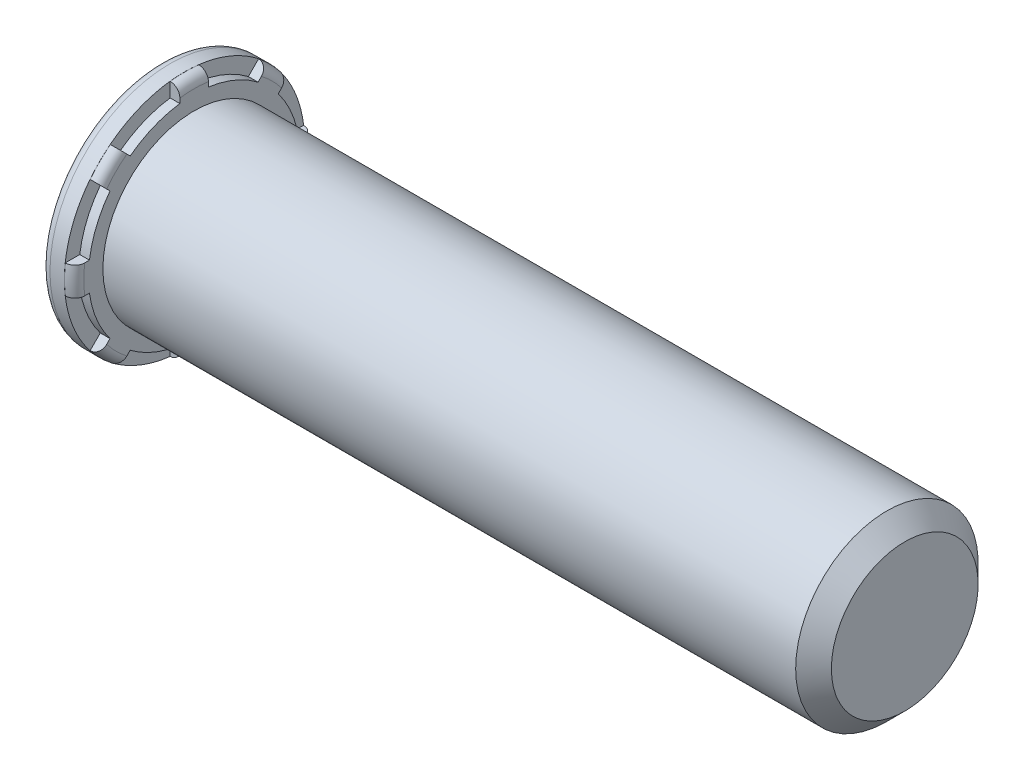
ISO-10303-21;
HEADER;
FILE_DESCRIPTION(('STEP AP214'),'2;1');
FILE_NAME('part.step','',(''),(''),'','','');
FILE_SCHEMA(('AUTOMOTIVE_DESIGN { 1 0 10303 214 1 1 1 1 }'));
ENDSEC;
DATA;
#1=APPLICATION_CONTEXT('core data for automotive mechanical design processes');
#2=APPLICATION_PROTOCOL_DEFINITION('international standard','automotive_design',2000,#1);
#3=PRODUCT_CONTEXT('',#1,'mechanical');
#4=PRODUCT('Part','Part','',(#3));
#5=PRODUCT_RELATED_PRODUCT_CATEGORY('part','',(#4));
#6=PRODUCT_DEFINITION_FORMATION('','',#4);
#7=PRODUCT_DEFINITION_CONTEXT('part definition',#1,'design');
#8=PRODUCT_DEFINITION('design','',#6,#7);
#9=PRODUCT_DEFINITION_SHAPE('','',#8);
#10=(LENGTH_UNIT() NAMED_UNIT(*) SI_UNIT(.MILLI.,.METRE.));
#11=(NAMED_UNIT(*) PLANE_ANGLE_UNIT() SI_UNIT($,.RADIAN.));
#12=(NAMED_UNIT(*) SI_UNIT($,.STERADIAN.) SOLID_ANGLE_UNIT());
#13=UNCERTAINTY_MEASURE_WITH_UNIT(LENGTH_MEASURE(1.E-05),#10,'distance_accuracy_value','');
#14=(GEOMETRIC_REPRESENTATION_CONTEXT(3) GLOBAL_UNCERTAINTY_ASSIGNED_CONTEXT((#13)) GLOBAL_UNIT_ASSIGNED_CONTEXT((#10,
#11,#12)) REPRESENTATION_CONTEXT('',''));
#15=CARTESIAN_POINT('',(0.,0.,0.));
#16=DIRECTION('',(0.,0.,1.));
#17=DIRECTION('',(1.,0.,0.));
#18=AXIS2_PLACEMENT_3D('',#15,#16,#17);
#19=CARTESIAN_POINT('',(0.00254000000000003,0.,0.));
#20=DIRECTION('',(-1.,0.,0.));
#21=DIRECTION('',(0.,0.,1.));
#22=AXIS2_PLACEMENT_3D('',#19,#20,#21);
#23=TOROIDAL_SURFACE('',#22,2.91846,0.254);
#24=CARTESIAN_POINT('',(0.223799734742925,1.69042669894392,2.22425889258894));
#25=CARTESIAN_POINT('',(0.230889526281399,1.69938443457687,2.23321662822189));
#26=CARTESIAN_POINT('',(0.236884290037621,1.70877095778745,2.24260315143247));
#27=CARTESIAN_POINT('',(0.24656571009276,1.72811391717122,2.26194611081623));
#28=CARTESIAN_POINT('',(0.250254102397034,1.73806991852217,2.27190211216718));
#29=CARTESIAN_POINT('',(0.25521668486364,1.75828229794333,2.29211449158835));
#30=CARTESIAN_POINT('',(0.256489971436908,1.76853878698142,2.30237098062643));
#31=CARTESIAN_POINT('',(0.256587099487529,1.78905578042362,2.32288797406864));
#32=CARTESIAN_POINT('',(0.255411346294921,1.79931628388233,2.33314847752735));
#33=CARTESIAN_POINT('',(0.25063746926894,1.81956342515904,2.35339561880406));
#34=CARTESIAN_POINT('',(0.247036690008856,1.82954975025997,2.36338194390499));
#35=CARTESIAN_POINT('',(0.237506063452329,1.84895222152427,2.38278441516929));
#36=CARTESIAN_POINT('',(0.231575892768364,1.85836828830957,2.39220048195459));
#37=CARTESIAN_POINT('',(0.217574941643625,1.87632282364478,2.4101550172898));
#38=CARTESIAN_POINT('',(0.209512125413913,1.88486439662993,2.41869659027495));
#39=CARTESIAN_POINT('',(0.191460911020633,1.90085917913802,2.43469137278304));
#40=CARTESIAN_POINT('',(0.181472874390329,1.90831259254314,2.44214478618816));
#41=CARTESIAN_POINT('',(0.159929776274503,1.92186418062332,2.45569637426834));
#42=CARTESIAN_POINT('',(0.148386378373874,1.92797162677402,2.46180382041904));
#43=CARTESIAN_POINT('',(0.123998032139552,1.93872088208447,2.47255307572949));
#44=CARTESIAN_POINT('',(0.111152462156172,1.94336198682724,2.47719418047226));
#45=CARTESIAN_POINT('',(0.0846209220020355,1.95101160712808,2.4848438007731));
#46=CARTESIAN_POINT('',(0.0709408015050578,1.95403029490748,2.4878624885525));
#47=CARTESIAN_POINT('',(0.0430778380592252,1.95838451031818,2.4922167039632));
#48=CARTESIAN_POINT('',(0.0288961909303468,1.95972379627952,2.49355598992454));
#49=CARTESIAN_POINT('',(0.0105640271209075,1.960349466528,2.49418166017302));
#50=CARTESIAN_POINT('',(0.00645100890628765,1.96041843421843,2.49425062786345));
#51=CARTESIAN_POINT('',(0.00233999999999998,1.96041566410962,2.49424785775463));
#52=B_SPLINE_CURVE_WITH_KNOTS('',3,(#24,#25,#26,#27,#28,#29,#30,#31,#32,#33,#34,#35,#36,#37,#38,
#39,#40,#41,#42,#43,#44,#45,#46,#47,#48,#49,#50,#51),.UNSPECIFIED.,.F.,.F.,(4,2,2,2,2,2,2,2,2,2,
2,2,2,4),(0.,0.0434919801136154,0.086951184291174,0.130426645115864,0.173894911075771,
0.217410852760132,0.26093283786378,0.304294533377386,0.347648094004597,0.390692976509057,
0.433758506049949,0.476550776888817,0.519247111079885,0.531584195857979),.UNSPECIFIED.);
#53=CARTESIAN_POINT('',(0.256539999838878,1.77941236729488,2.3132445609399));
#54=VERTEX_POINT('',#53);
#55=CARTESIAN_POINT('',(0.00254,1.96041572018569,2.49424791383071));
#56=VERTEX_POINT('',#55);
#57=EDGE_CURVE('E553',#54,#56,#52,.T.);
#58=ORIENTED_EDGE('',*,*,#57,.F.);
#59=CARTESIAN_POINT('',(0.25654,0.,0.));
#60=DIRECTION('',(-1.,0.,0.));
#61=DIRECTION('',(0.,0.,1.));
#62=AXIS2_PLACEMENT_3D('',#59,#60,#61);
#63=CIRCLE('',#62,2.91846);
#64=CARTESIAN_POINT('',(0.256539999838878,2.31324456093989,1.77941236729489));
#65=VERTEX_POINT('',#64);
#66=EDGE_CURVE('E556',#54,#65,#63,.T.);
#67=ORIENTED_EDGE('',*,*,#66,.T.);
#68=CARTESIAN_POINT('',(0.00234,2.49424785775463,1.96041566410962));
#69=CARTESIAN_POINT('',(0.0165538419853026,2.49426468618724,1.96043249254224));
#70=CARTESIAN_POINT('',(0.0307644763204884,2.49341464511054,1.95958245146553));
#71=CARTESIAN_POINT('',(0.0587716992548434,2.49004633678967,1.95621414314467));
#72=CARTESIAN_POINT('',(0.0725686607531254,2.48752962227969,1.95369742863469));
#73=CARTESIAN_POINT('',(0.0993742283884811,2.48089193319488,1.94705973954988));
#74=CARTESIAN_POINT('',(0.112382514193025,2.47677031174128,1.94293811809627));
#75=CARTESIAN_POINT('',(0.137237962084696,2.46704700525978,1.93321481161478));
#76=CARTESIAN_POINT('',(0.149085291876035,2.46144553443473,1.92761334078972));
#77=CARTESIAN_POINT('',(0.171325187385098,2.44890490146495,1.91507270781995));
#78=CARTESIAN_POINT('',(0.181713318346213,2.44196180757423,1.90812961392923));
#79=CARTESIAN_POINT('',(0.200708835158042,2.42694731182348,1.89311511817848));
#80=CARTESIAN_POINT('',(0.209315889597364,2.41887570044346,1.88504350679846));
#81=CARTESIAN_POINT('',(0.224565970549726,2.40177583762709,1.86794364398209));
#82=CARTESIAN_POINT('',(0.231195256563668,2.39274145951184,1.85890926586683));
#83=CARTESIAN_POINT('',(0.242231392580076,2.37401932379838,1.84018713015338));
#84=CARTESIAN_POINT('',(0.246638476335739,2.36433163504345,1.83049944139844));
#85=CARTESIAN_POINT('',(0.253138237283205,2.34450323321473,1.81067103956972));
#86=CARTESIAN_POINT('',(0.255214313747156,2.33435979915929,1.80052760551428));
#87=CARTESIAN_POINT('',(0.256941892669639,2.31396496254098,1.78013276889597));
#88=CARTESIAN_POINT('',(0.25659216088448,2.3037135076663,1.7698813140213));
#89=CARTESIAN_POINT('',(0.253469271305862,2.28334028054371,1.7495080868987));
#90=CARTESIAN_POINT('',(0.25068265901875,2.27321954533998,1.73938735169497));
#91=CARTESIAN_POINT('',(0.242746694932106,2.25346891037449,1.71963671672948));
#92=CARTESIAN_POINT('',(0.237602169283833,2.24383805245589,1.71000585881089));
#93=CARTESIAN_POINT('',(0.228994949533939,2.23108854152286,1.69725634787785));
#94=CARTESIAN_POINT('',(0.226473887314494,2.22764230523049,1.69381011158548));
#95=CARTESIAN_POINT('',(0.22379973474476,2.22425889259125,1.69042669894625));
#96=B_SPLINE_CURVE_WITH_KNOTS('',3,(#68,#69,#70,#71,#72,#73,#74,#75,#76,#77,#78,#79,#80,#81,#82,
#83,#84,#85,#86,#87,#88,#89,#90,#91,#92,#93,#94,#95),.UNSPECIFIED.,.F.,.F.,(4,2,2,2,2,2,2,2,2,2,
2,2,2,4),(0.,0.0425837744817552,0.0851279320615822,0.127689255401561,0.170244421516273,
0.212926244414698,0.255616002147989,0.298595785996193,0.341571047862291,0.384850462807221,
0.428151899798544,0.471693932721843,0.515147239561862,0.531596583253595),.UNSPECIFIED.);
#97=CARTESIAN_POINT('',(0.00254,2.4942479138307,1.9604157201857));
#98=VERTEX_POINT('',#97);
#99=EDGE_CURVE('E457',#98,#65,#96,.T.);
#100=ORIENTED_EDGE('',*,*,#99,.F.);
#101=CARTESIAN_POINT('',(0.00254,0.,0.));
#102=DIRECTION('',(-1.,0.,0.));
#103=DIRECTION('',(0.,0.,1.));
#104=AXIS2_PLACEMENT_3D('',#101,#102,#103);
#105=CIRCLE('',#104,3.17246);
#106=EDGE_CURVE('E558',#56,#98,#105,.T.);
#107=ORIENTED_EDGE('',*,*,#106,.F.);
#108=EDGE_LOOP('',(#58,#67,#100,#107));
#109=FACE_BOUND('',#108,.T.);
#110=ADVANCED_FACE('F39',(#109),#23,.T.);
#111=CARTESIAN_POINT('',(0.238191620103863,0.377476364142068,2.79832960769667));
#112=CARTESIAN_POINT('',(0.232859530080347,0.377476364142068,2.7849547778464));
#113=CARTESIAN_POINT('',(0.226400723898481,0.377476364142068,2.77201823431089));
#114=CARTESIAN_POINT('',(0.211402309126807,0.377476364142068,2.74739888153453));
#115=CARTESIAN_POINT('',(0.20286032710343,0.377476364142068,2.73571752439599));
#116=CARTESIAN_POINT('',(0.183932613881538,0.377476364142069,2.71395826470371));
#117=CARTESIAN_POINT('',(0.173547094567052,0.377476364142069,2.70388017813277));
#118=CARTESIAN_POINT('',(0.151224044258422,0.377476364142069,2.68562738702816));
#119=CARTESIAN_POINT('',(0.139286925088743,0.377476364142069,2.67745217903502));
#120=CARTESIAN_POINT('',(0.11427859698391,0.377476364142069,2.66329380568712));
#121=CARTESIAN_POINT('',(0.101215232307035,0.377476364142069,2.65729678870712));
#122=CARTESIAN_POINT('',(0.0742607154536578,0.377476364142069,2.64760296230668));
#123=CARTESIAN_POINT('',(0.0603695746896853,0.377476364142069,2.64390612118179));
#124=CARTESIAN_POINT('',(0.032285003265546,0.377476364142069,2.63894824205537));
#125=CARTESIAN_POINT('',(0.0180952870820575,0.377476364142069,2.63766614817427));
#126=CARTESIAN_POINT('',(-0.0102969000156,0.377476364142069,2.63751273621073));
#127=CARTESIAN_POINT('',(-0.0244993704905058,0.377476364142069,2.63864133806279));
#128=CARTESIAN_POINT('',(-0.0524564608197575,0.377476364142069,2.64326569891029));
#129=CARTESIAN_POINT('',(-0.0662126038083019,0.377476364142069,2.64675226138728));
#130=CARTESIAN_POINT('',(-0.0929470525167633,0.377476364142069,2.65597829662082));
#131=CARTESIAN_POINT('',(-0.10592535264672,0.377476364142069,2.66171778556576));
#132=CARTESIAN_POINT('',(-0.130782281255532,0.377476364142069,2.67530120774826));
#133=CARTESIAN_POINT('',(-0.142657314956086,0.377476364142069,2.6831517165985));
#134=CARTESIAN_POINT('',(-0.164934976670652,0.377476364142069,2.70071950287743));
#135=CARTESIAN_POINT('',(-0.175337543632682,0.377476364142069,2.71043685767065));
#136=CARTESIAN_POINT('',(-0.194468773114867,0.377476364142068,2.73154824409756));
#137=CARTESIAN_POINT('',(-0.203182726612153,0.377476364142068,2.7429556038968));
#138=CARTESIAN_POINT('',(-0.218592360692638,0.377476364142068,2.76706045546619));
#139=CARTESIAN_POINT('',(-0.225287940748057,0.377476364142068,2.77975801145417));
#140=CARTESIAN_POINT('',(-0.236532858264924,0.377476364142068,2.8062071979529));
#141=CARTESIAN_POINT('',(-0.241062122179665,0.377476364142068,2.81996736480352));
#142=CARTESIAN_POINT('',(-0.247760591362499,0.377476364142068,2.84805074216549));
#143=CARTESIAN_POINT('',(-0.249929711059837,0.377476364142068,2.86237397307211));
#144=CARTESIAN_POINT('',(-0.251853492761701,0.377476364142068,2.89126138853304));
#145=CARTESIAN_POINT('',(-0.251594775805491,0.377476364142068,2.90582646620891));
#146=CARTESIAN_POINT('',(-0.248635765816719,0.377476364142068,2.93470670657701));
#147=CARTESIAN_POINT('',(-0.245935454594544,0.377476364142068,2.94902186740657));
#148=CARTESIAN_POINT('',(-0.23816517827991,0.377476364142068,2.97699274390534));
#149=CARTESIAN_POINT('',(-0.233095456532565,0.377476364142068,2.99064852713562));
#150=CARTESIAN_POINT('',(-0.220724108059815,0.377476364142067,3.01690892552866));
#151=CARTESIAN_POINT('',(-0.213422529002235,0.377476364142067,3.0295135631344));
#152=CARTESIAN_POINT('',(-0.196831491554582,0.377476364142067,3.05324479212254));
#153=CARTESIAN_POINT('',(-0.187552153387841,0.377476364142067,3.06437845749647));
#154=CARTESIAN_POINT('',(-0.16724346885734,0.377476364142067,3.08491548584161));
#155=CARTESIAN_POINT('',(-0.156214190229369,0.377476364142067,3.09431891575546));
#156=CARTESIAN_POINT('',(-0.13280545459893,0.377476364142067,3.11105495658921));
#157=CARTESIAN_POINT('',(-0.120436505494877,0.377476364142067,3.11840226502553));
#158=CARTESIAN_POINT('',(-0.0946343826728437,0.377476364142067,3.13089981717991));
#159=CARTESIAN_POINT('',(-0.0812012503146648,0.377476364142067,3.13605014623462));
#160=CARTESIAN_POINT('',(-0.0537486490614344,0.377476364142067,3.14397352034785));
#161=CARTESIAN_POINT('',(-0.0397336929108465,0.377476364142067,3.14676220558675));
#162=CARTESIAN_POINT('',(-0.0114343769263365,0.377476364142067,3.1499375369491));
#163=CARTESIAN_POINT('',(0.0028499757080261,0.377476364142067,3.15032424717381));
#164=CARTESIAN_POINT('',(0.0312275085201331,0.377476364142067,3.14868726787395));
#165=CARTESIAN_POINT('',(0.0453211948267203,0.377476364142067,3.14667233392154));
#166=CARTESIAN_POINT('',(0.072970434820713,0.377476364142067,3.14030611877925));
#167=CARTESIAN_POINT('',(0.086525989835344,0.377476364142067,3.13595484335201));
#168=CARTESIAN_POINT('',(0.11272412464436,0.377476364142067,3.1250404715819));
#169=CARTESIAN_POINT('',(0.125366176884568,0.377476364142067,3.1184761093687));
#170=CARTESIAN_POINT('',(0.149375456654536,0.377476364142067,3.10332731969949));
#171=CARTESIAN_POINT('',(0.160742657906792,0.377476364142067,3.0947428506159));
#172=CARTESIAN_POINT('',(0.181937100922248,0.377476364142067,3.07575737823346));
#173=CARTESIAN_POINT('',(0.1917570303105,0.377476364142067,3.06534821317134));
#174=CARTESIAN_POINT('',(0.209524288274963,0.377476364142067,3.04303943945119));
#175=CARTESIAN_POINT('',(0.217471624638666,0.377476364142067,3.03113983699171));
#176=CARTESIAN_POINT('',(0.231328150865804,0.377476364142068,3.00609948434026));
#177=CARTESIAN_POINT('',(0.237222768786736,0.377476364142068,2.99295067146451));
#178=CARTESIAN_POINT('',(0.246739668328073,0.377476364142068,2.96585101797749));
#179=CARTESIAN_POINT('',(0.250361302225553,0.377476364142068,2.9518999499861));
#180=CARTESIAN_POINT('',(0.255253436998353,0.377476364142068,2.92348484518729));
#181=CARTESIAN_POINT('',(0.256506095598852,0.377476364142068,2.90901774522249));
#182=CARTESIAN_POINT('',(0.2565724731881,0.377476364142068,2.88008957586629));
#183=CARTESIAN_POINT('',(0.255388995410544,0.377476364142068,2.86562851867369));
#184=CARTESIAN_POINT('',(0.251493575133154,0.377476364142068,2.84230325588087));
#185=CARTESIAN_POINT('',(0.249493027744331,0.377476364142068,2.83331417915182));
#186=CARTESIAN_POINT('',(0.244545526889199,0.377476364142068,2.81560029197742));
#187=CARTESIAN_POINT('',(0.241598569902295,0.377476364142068,2.80687548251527));
#188=CARTESIAN_POINT('',(0.238191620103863,0.377476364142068,2.79832960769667));
#189=B_SPLINE_CURVE_WITH_KNOTS('',3,(#111,#112,#113,#114,#115,#116,#117,#118,#119,#120,#121,
#122,#123,#124,#125,#126,#127,#128,#129,#130,#131,#132,#133,#134,#135,#136,#137,#138,#139,#140,
#141,#142,#143,#144,#145,#146,#147,#148,#149,#150,#151,#152,#153,#154,#155,#156,#157,#158,#159,
#160,#161,#162,#163,#164,#165,#166,#167,#168,#169,#170,#171,#172,#173,#174,#175,#176,#177,#178,
#179,#180,#181,#182,#183,#184,#185,#186,#187,#188),.UNSPECIFIED.,.T.,.F.,(4,2,2,2,2,2,2,2,2,2,2,
2,2,2,2,2,2,2,2,2,2,2,2,2,2,2,2,2,2,2,2,2,2,2,2,2,2,2,4),(0.,0.0431623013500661,
0.0863740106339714,0.129580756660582,0.172776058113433,0.215691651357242,0.258606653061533,
0.301145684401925,0.343683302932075,0.386055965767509,0.42842893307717,0.470935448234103,
0.513443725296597,0.556307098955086,0.599172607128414,0.642427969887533,0.685684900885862,
0.729180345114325,0.772676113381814,0.816167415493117,0.85965778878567,0.90293074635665,
0.946202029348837,0.989155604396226,1.03210751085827,1.07477268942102,1.11743672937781,
1.15994570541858,1.2024545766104,1.24498780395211,1.2875219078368,1.33025135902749,
1.37298063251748,1.4160073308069,1.45904628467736,1.50240812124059,1.54572008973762,
1.57329862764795,1.60087726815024),.UNSPECIFIED.);
#190=CARTESIAN_POINT('',(0.00254,0.377476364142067,3.1499228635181));
#191=VERTEX_POINT('',#190);
#192=CARTESIAN_POINT('',(0.256539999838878,0.377476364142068,2.89394546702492));
#193=VERTEX_POINT('',#192);
#194=EDGE_CURVE('E561',#191,#193,#189,.T.);
#195=ORIENTED_EDGE('',*,*,#194,.F.);
#196=CARTESIAN_POINT('',(0.00254,-0.377476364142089,3.1499228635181));
#197=VERTEX_POINT('',#196);
#198=EDGE_CURVE('E675',#197,#191,#105,.T.);
#199=ORIENTED_EDGE('',*,*,#198,.F.);
#200=CARTESIAN_POINT('',(0.238191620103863,-0.377476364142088,2.79832960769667));
#201=CARTESIAN_POINT('',(0.243561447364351,-0.377476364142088,2.81180246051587));
#202=CARTESIAN_POINT('',(0.247795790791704,-0.377476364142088,2.82573958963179));
#203=CARTESIAN_POINT('',(0.253868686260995,-0.377476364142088,2.85413894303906));
#204=CARTESIAN_POINT('',(0.255704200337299,-0.377476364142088,2.8686018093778));
#205=CARTESIAN_POINT('',(0.256921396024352,-0.377476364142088,2.89762467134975));
#206=CARTESIAN_POINT('',(0.25630430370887,-0.377476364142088,2.91218461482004));
#207=CARTESIAN_POINT('',(0.252633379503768,-0.377476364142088,2.94098994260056));
#208=CARTESIAN_POINT('',(0.24958019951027,-0.377476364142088,2.95523541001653));
#209=CARTESIAN_POINT('',(0.241121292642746,-0.377476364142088,2.98300345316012));
#210=CARTESIAN_POINT('',(0.235716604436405,-0.377476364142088,2.99652634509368));
#211=CARTESIAN_POINT('',(0.222701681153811,-0.377476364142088,3.0224665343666));
#212=CARTESIAN_POINT('',(0.2150913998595,-0.377476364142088,3.0348838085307));
#213=CARTESIAN_POINT('',(0.197922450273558,-0.377476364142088,3.05818778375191));
#214=CARTESIAN_POINT('',(0.188374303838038,-0.377476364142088,3.06908223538));
#215=CARTESIAN_POINT('',(0.167572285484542,-0.377476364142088,3.08909865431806));
#216=CARTESIAN_POINT('',(0.156318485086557,-0.377476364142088,3.09822069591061));
#217=CARTESIAN_POINT('',(0.132513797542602,-0.377476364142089,3.11436172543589));
#218=CARTESIAN_POINT('',(0.119973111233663,-0.377476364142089,3.12139575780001));
#219=CARTESIAN_POINT('',(0.0938831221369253,-0.377476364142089,3.13324257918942));
#220=CARTESIAN_POINT('',(0.0803338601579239,-0.377476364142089,3.13805545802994));
#221=CARTESIAN_POINT('',(0.0527064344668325,-0.377476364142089,3.1452927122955));
#222=CARTESIAN_POINT('',(0.038632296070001,-0.377476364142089,3.1477324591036));
#223=CARTESIAN_POINT('',(0.0102742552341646,-0.377476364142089,3.1502056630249));
#224=CARTESIAN_POINT('',(-0.00400964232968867,-0.377476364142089,3.15023917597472));
#225=CARTESIAN_POINT('',(-0.0323310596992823,-0.377476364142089,3.14790297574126));
#226=CARTESIAN_POINT('',(-0.0463692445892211,-0.377476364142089,3.14554131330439));
#227=CARTESIAN_POINT('',(-0.0738503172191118,-0.377476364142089,3.13849663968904));
#228=CARTESIAN_POINT('',(-0.0872932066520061,-0.377476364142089,3.13381363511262));
#229=CARTESIAN_POINT('',(-0.113216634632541,-0.377476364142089,3.12225833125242));
#230=CARTESIAN_POINT('',(-0.125696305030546,-0.377476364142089,3.11538408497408));
#231=CARTESIAN_POINT('',(-0.149331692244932,-0.377476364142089,3.09964753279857));
#232=CARTESIAN_POINT('',(-0.16048738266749,-0.377476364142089,3.09078518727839));
#233=CARTESIAN_POINT('',(-0.181217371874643,-0.377476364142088,3.07128017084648));
#234=CARTESIAN_POINT('',(-0.190783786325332,-0.377476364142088,3.06062912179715));
#235=CARTESIAN_POINT('',(-0.208007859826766,-0.377476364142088,3.03788195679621));
#236=CARTESIAN_POINT('',(-0.21566545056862,-0.377476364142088,3.02578578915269));
#237=CARTESIAN_POINT('',(-0.228913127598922,-0.377476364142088,3.00039940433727));
#238=CARTESIAN_POINT('',(-0.234488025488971,-0.377476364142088,2.98710126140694));
#239=CARTESIAN_POINT('',(-0.243343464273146,-0.377476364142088,2.95976185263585));
#240=CARTESIAN_POINT('',(-0.246623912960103,-0.377476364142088,2.94572055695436));
#241=CARTESIAN_POINT('',(-0.2508188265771,-0.377476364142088,2.91718950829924));
#242=CARTESIAN_POINT('',(-0.251716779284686,-0.377476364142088,2.90269732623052));
#243=CARTESIAN_POINT('',(-0.251076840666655,-0.377476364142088,2.87376667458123));
#244=CARTESIAN_POINT('',(-0.249538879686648,-0.377476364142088,2.85932820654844));
#245=CARTESIAN_POINT('',(-0.244059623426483,-0.377476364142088,2.83085834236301));
#246=CARTESIAN_POINT('',(-0.240109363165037,-0.377476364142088,2.81682867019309));
#247=CARTESIAN_POINT('',(-0.229905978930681,-0.377476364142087,2.78963296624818));
#248=CARTESIAN_POINT('',(-0.223652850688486,-0.377476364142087,2.77646693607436));
#249=CARTESIAN_POINT('',(-0.209027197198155,-0.377476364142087,2.75139800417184));
#250=CARTESIAN_POINT('',(-0.200658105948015,-0.377476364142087,2.73949309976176));
#251=CARTESIAN_POINT('',(-0.182027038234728,-0.377476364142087,2.71726980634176));
#252=CARTESIAN_POINT('',(-0.171765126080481,-0.377476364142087,2.70695136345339));
#253=CARTESIAN_POINT('',(-0.149714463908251,-0.377476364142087,2.68827362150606));
#254=CARTESIAN_POINT('',(-0.137936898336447,-0.377476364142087,2.67990112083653));
#255=CARTESIAN_POINT('',(-0.113132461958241,-0.377476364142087,2.66527442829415));
#256=CARTESIAN_POINT('',(-0.10010565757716,-0.377476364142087,2.65902012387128));
#257=CARTESIAN_POINT('',(-0.0733048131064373,-0.377476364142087,2.64886909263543));
#258=CARTESIAN_POINT('',(-0.0595390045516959,-0.377476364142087,2.64495062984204));
#259=CARTESIAN_POINT('',(-0.0315430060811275,-0.377476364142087,2.63949885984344));
#260=CARTESIAN_POINT('',(-0.0173128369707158,-0.377476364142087,2.63796544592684));
#261=CARTESIAN_POINT('',(0.0111008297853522,-0.377476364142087,2.63733287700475));
#262=CARTESIAN_POINT('',(0.0252839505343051,-0.377476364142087,2.63821665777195));
#263=CARTESIAN_POINT('',(0.0532991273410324,-0.377476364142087,2.64235503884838));
#264=CARTESIAN_POINT('',(0.0671312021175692,-0.377476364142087,2.64560951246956));
#265=CARTESIAN_POINT('',(0.0940420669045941,-0.377476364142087,2.65438712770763));
#266=CARTESIAN_POINT('',(0.107121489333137,-0.377476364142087,2.65990833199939));
#267=CARTESIAN_POINT('',(0.132178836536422,-0.377476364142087,2.67305743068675));
#268=CARTESIAN_POINT('',(0.144156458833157,-0.377476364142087,2.68068590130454));
#269=CARTESIAN_POINT('',(0.166749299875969,-0.377476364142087,2.69788007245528));
#270=CARTESIAN_POINT('',(0.177355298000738,-0.377476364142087,2.70745787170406));
#271=CARTESIAN_POINT('',(0.196816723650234,-0.377476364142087,2.72823678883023));
#272=CARTESIAN_POINT('',(0.205674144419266,-0.377476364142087,2.73943603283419));
#273=CARTESIAN_POINT('',(0.218446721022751,-0.377476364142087,2.75867174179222));
#274=CARTESIAN_POINT('',(0.222967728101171,-0.377476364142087,2.76631345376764));
#275=CARTESIAN_POINT('',(0.231197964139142,-0.377476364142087,2.78202208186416));
#276=CARTESIAN_POINT('',(0.234907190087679,-0.377476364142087,2.79008899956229));
#277=CARTESIAN_POINT('',(0.238191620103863,-0.377476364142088,2.79832960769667));
#278=B_SPLINE_CURVE_WITH_KNOTS('',3,(#200,#201,#202,#203,#204,#205,#206,#207,#208,#209,#210,
#211,#212,#213,#214,#215,#216,#217,#218,#219,#220,#221,#222,#223,#224,#225,#226,#227,#228,#229,
#230,#231,#232,#233,#234,#235,#236,#237,#238,#239,#240,#241,#242,#243,#244,#245,#246,#247,#248,
#249,#250,#251,#252,#253,#254,#255,#256,#257,#258,#259,#260,#261,#262,#263,#264,#265,#266,#267,
#268,#269,#270,#271,#272,#273,#274,#275,#276,#277),.UNSPECIFIED.,.T.,.F.,(4,2,2,2,2,2,2,2,2,2,2,
2,2,2,2,2,2,2,2,2,2,2,2,2,2,2,2,2,2,2,2,2,2,2,2,2,2,2,4),(0.,0.0434781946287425,
0.0870113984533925,0.130522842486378,0.174022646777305,0.217503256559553,0.260984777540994,
0.304236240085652,0.347485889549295,0.390415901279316,0.433344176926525,0.475992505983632,
0.518639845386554,0.561144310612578,0.603648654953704,0.646190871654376,0.68873393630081,
0.731482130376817,0.774231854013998,0.817287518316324,0.860344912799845,0.903699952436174,
0.947056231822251,0.990574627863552,1.03409310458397,1.07754140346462,1.12098822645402,
1.16413108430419,1.20727164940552,1.25000423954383,1.29273491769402,1.33516471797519,
1.37759225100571,1.41998359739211,1.46238654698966,1.50506117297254,1.54768686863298,
1.57428000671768,1.60087324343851),.UNSPECIFIED.);
#279=CARTESIAN_POINT('',(0.256539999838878,-0.377476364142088,2.89394546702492));
#280=VERTEX_POINT('',#279);
#281=EDGE_CURVE('E625',#280,#197,#278,.T.);
#282=ORIENTED_EDGE('',*,*,#281,.F.);
#283=EDGE_CURVE('E565',#280,#193,#63,.T.);
#284=ORIENTED_EDGE('',*,*,#283,.T.);
#285=EDGE_LOOP('',(#195,#199,#282,#284));
#286=FACE_BOUND('',#285,.T.);
#287=ADVANCED_FACE('F544',(#286),#23,.T.);
#288=CARTESIAN_POINT('',(0.00234,-1.96041566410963,2.49424785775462));
#289=CARTESIAN_POINT('',(0.0165538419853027,-1.96043249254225,2.49426468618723));
#290=CARTESIAN_POINT('',(0.0307644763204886,-1.95958245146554,2.49341464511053));
#291=CARTESIAN_POINT('',(0.0587716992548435,-1.95621414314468,2.49004633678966));
#292=CARTESIAN_POINT('',(0.0725686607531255,-1.95369742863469,2.48752962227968));
#293=CARTESIAN_POINT('',(0.0993742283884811,-1.94705973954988,2.48089193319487));
#294=CARTESIAN_POINT('',(0.112382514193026,-1.94293811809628,2.47677031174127));
#295=CARTESIAN_POINT('',(0.137237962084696,-1.93321481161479,2.46704700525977));
#296=CARTESIAN_POINT('',(0.149085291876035,-1.92761334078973,2.46144553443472));
#297=CARTESIAN_POINT('',(0.171325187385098,-1.91507270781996,2.44890490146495));
#298=CARTESIAN_POINT('',(0.181713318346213,-1.90812961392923,2.44196180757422));
#299=CARTESIAN_POINT('',(0.200708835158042,-1.89311511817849,2.42694731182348));
#300=CARTESIAN_POINT('',(0.209315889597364,-1.88504350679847,2.41887570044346));
#301=CARTESIAN_POINT('',(0.224565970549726,-1.86794364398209,2.40177583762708));
#302=CARTESIAN_POINT('',(0.231195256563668,-1.85890926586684,2.39274145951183));
#303=CARTESIAN_POINT('',(0.242231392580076,-1.84018713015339,2.37401932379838));
#304=CARTESIAN_POINT('',(0.246638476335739,-1.83049944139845,2.36433163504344));
#305=CARTESIAN_POINT('',(0.253138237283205,-1.81067103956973,2.34450323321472));
#306=CARTESIAN_POINT('',(0.255214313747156,-1.80052760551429,2.33435979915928));
#307=CARTESIAN_POINT('',(0.256941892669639,-1.78013276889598,2.31396496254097));
#308=CARTESIAN_POINT('',(0.25659216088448,-1.76988131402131,2.3037135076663));
#309=CARTESIAN_POINT('',(0.253469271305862,-1.74950808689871,2.2833402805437));
#310=CARTESIAN_POINT('',(0.25068265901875,-1.73938735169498,2.27321954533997));
#311=CARTESIAN_POINT('',(0.242746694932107,-1.71963671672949,2.25346891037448));
#312=CARTESIAN_POINT('',(0.237602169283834,-1.7100058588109,2.24383805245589));
#313=CARTESIAN_POINT('',(0.228994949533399,-1.69725634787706,2.23108854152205));
#314=CARTESIAN_POINT('',(0.226473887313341,-1.69381011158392,2.22764230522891));
#315=CARTESIAN_POINT('',(0.223799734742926,-1.69042669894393,2.22425889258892));
#316=B_SPLINE_CURVE_WITH_KNOTS('',3,(#288,#289,#290,#291,#292,#293,#294,#295,#296,#297,#298,
#299,#300,#301,#302,#303,#304,#305,#306,#307,#308,#309,#310,#311,#312,#313,#314,#315),
.UNSPECIFIED.,.F.,.F.,(4,2,2,2,2,2,2,2,2,2,2,2,2,4),(0.,0.0425837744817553,0.0851279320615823,
0.127689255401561,0.170244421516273,0.212926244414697,0.255616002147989,0.298595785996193,
0.341571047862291,0.384850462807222,0.428151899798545,0.471693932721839,0.515147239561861,
0.531596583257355),.UNSPECIFIED.);
#317=CARTESIAN_POINT('',(0.00254,-1.9604157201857,2.49424791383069));
#318=VERTEX_POINT('',#317);
#319=CARTESIAN_POINT('',(0.256539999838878,-1.7794123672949,2.31324456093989));
#320=VERTEX_POINT('',#319);
#321=EDGE_CURVE('E605',#318,#320,#316,.T.);
#322=ORIENTED_EDGE('',*,*,#321,.F.);
#323=CARTESIAN_POINT('',(0.00254,-2.49424791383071,1.96041572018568));
#324=VERTEX_POINT('',#323);
#325=EDGE_CURVE('E740',#324,#318,#105,.T.);
#326=ORIENTED_EDGE('',*,*,#325,.F.);
#327=CARTESIAN_POINT('',(0.22379973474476,-2.22425889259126,1.69042669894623));
#328=CARTESIAN_POINT('',(0.230889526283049,-2.23321662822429,1.69938443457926));
#329=CARTESIAN_POINT('',(0.236884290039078,-2.24260315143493,1.7087709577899));
#330=CARTESIAN_POINT('',(0.246565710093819,-2.2619461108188,1.72811391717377));
#331=CARTESIAN_POINT('',(0.250254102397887,-2.27190211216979,1.73806991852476));
#332=CARTESIAN_POINT('',(0.255216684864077,-2.29211449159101,1.75828229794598));
#333=CARTESIAN_POINT('',(0.256489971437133,-2.30237098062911,1.76853878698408));
#334=CARTESIAN_POINT('',(0.25658709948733,-2.32288797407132,1.78905578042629));
#335=CARTESIAN_POINT('',(0.255411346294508,-2.33314847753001,1.79931628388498));
#336=CARTESIAN_POINT('',(0.250637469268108,-2.35339561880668,1.81956342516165));
#337=CARTESIAN_POINT('',(0.247036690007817,-2.36338194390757,1.82954975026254));
#338=CARTESIAN_POINT('',(0.237506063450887,-2.38278441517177,1.84895222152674));
#339=CARTESIAN_POINT('',(0.231575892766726,-2.39220048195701,1.85836828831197));
#340=CARTESIAN_POINT('',(0.217574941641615,-2.41015501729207,1.87632282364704));
#341=CARTESIAN_POINT('',(0.209512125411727,-2.41869659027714,1.8848643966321));
#342=CARTESIAN_POINT('',(0.191460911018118,-2.43469137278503,1.90085917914));
#343=CARTESIAN_POINT('',(0.181472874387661,-2.44214478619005,1.90831259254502));
#344=CARTESIAN_POINT('',(0.159929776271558,-2.45569637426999,1.92186418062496));
#345=CARTESIAN_POINT('',(0.148386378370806,-2.46180382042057,1.92797162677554));
#346=CARTESIAN_POINT('',(0.123998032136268,-2.47255307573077,1.93872088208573));
#347=CARTESIAN_POINT('',(0.111152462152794,-2.4771941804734,1.94336198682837));
#348=CARTESIAN_POINT('',(0.0846209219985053,-2.48484380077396,1.95101160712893));
#349=CARTESIAN_POINT('',(0.0709408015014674,-2.48786248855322,1.95403029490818));
#350=CARTESIAN_POINT('',(0.0430778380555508,-2.49221670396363,1.95838451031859));
#351=CARTESIAN_POINT('',(0.0288961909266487,-2.49355598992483,1.95972379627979));
#352=CARTESIAN_POINT('',(0.010564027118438,-2.49418166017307,1.96034946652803));
#353=CARTESIAN_POINT('',(0.00645100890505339,-2.49425062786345,1.96041843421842));
#354=CARTESIAN_POINT('',(0.00233999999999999,-2.49424785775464,1.96041566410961));
#355=B_SPLINE_CURVE_WITH_KNOTS('',3,(#327,#328,#329,#330,#331,#332,#333,#334,#335,#336,#337,
#338,#339,#340,#341,#342,#343,#344,#345,#346,#347,#348,#349,#350,#351,#352,#353,#354),
.UNSPECIFIED.,.F.,.F.,(4,2,2,2,2,2,2,2,2,2,2,2,2,4),(0.,0.0434919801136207,0.0869511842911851,
0.130426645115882,0.173894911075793,0.217410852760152,0.260932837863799,0.304294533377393,
0.347648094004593,0.390692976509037,0.433758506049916,0.476550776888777,0.519247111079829,
0.531584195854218),.UNSPECIFIED.);
#356=CARTESIAN_POINT('',(0.256539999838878,-2.31324456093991,1.77941236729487));
#357=VERTEX_POINT('',#356);
#358=EDGE_CURVE('E607',#357,#324,#355,.T.);
#359=ORIENTED_EDGE('',*,*,#358,.F.);
#360=EDGE_CURVE('E570',#357,#320,#63,.T.);
#361=ORIENTED_EDGE('',*,*,#360,.T.);
#362=EDGE_LOOP('',(#322,#326,#359,#361));
#363=FACE_BOUND('',#362,.T.);
#364=ADVANCED_FACE('F549',(#363),#23,.T.);
#365=CARTESIAN_POINT('',(0.0765587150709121,-3.13881948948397,0.377476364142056));
#366=CARTESIAN_POINT('',(0.0901813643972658,-3.13463897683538,0.377476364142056));
#367=CARTESIAN_POINT('',(0.10345966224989,-3.12929995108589,0.377476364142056));
#368=CARTESIAN_POINT('',(0.1289399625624,-3.11645968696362,0.377476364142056));
#369=CARTESIAN_POINT('',(0.141140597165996,-3.10895575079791,0.377476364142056));
#370=CARTESIAN_POINT('',(0.164102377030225,-3.09201326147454,0.377476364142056));
#371=CARTESIAN_POINT('',(0.174864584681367,-3.08257614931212,0.377476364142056));
#372=CARTESIAN_POINT('',(0.194658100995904,-3.06203972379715,0.377476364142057));
#373=CARTESIAN_POINT('',(0.203689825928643,-3.05094081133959,0.377476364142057));
#374=CARTESIAN_POINT('',(0.219820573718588,-3.02733666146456,0.377476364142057));
#375=CARTESIAN_POINT('',(0.226909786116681,-3.01482472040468,0.377476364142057));
#376=CARTESIAN_POINT('',(0.238904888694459,-2.98879423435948,0.377476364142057));
#377=CARTESIAN_POINT('',(0.243810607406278,-2.97527561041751,0.377476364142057));
#378=CARTESIAN_POINT('',(0.251335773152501,-2.94750989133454,0.377476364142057));
#379=CARTESIAN_POINT('',(0.253938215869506,-2.93325818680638,0.377476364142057));
#380=CARTESIAN_POINT('',(0.256727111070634,-2.90452024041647,0.377476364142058));
#381=CARTESIAN_POINT('',(0.256913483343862,-2.89003399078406,0.377476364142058));
#382=CARTESIAN_POINT('',(0.254861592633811,-2.86115848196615,0.377476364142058));
#383=CARTESIAN_POINT('',(0.252610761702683,-2.84677011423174,0.377476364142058));
#384=CARTESIAN_POINT('',(0.2457268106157,-2.81857475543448,0.377476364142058));
#385=CARTESIAN_POINT('',(0.241093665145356,-2.8047677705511,0.377476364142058));
#386=CARTESIAN_POINT('',(0.229569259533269,-2.77812330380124,0.377476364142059));
#387=CARTESIAN_POINT('',(0.222677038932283,-2.76528623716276,0.377476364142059));
#388=CARTESIAN_POINT('',(0.20682445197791,-2.74095937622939,0.377476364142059));
#389=CARTESIAN_POINT('',(0.197864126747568,-2.72946955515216,0.377476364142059));
#390=CARTESIAN_POINT('',(0.178177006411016,-2.70823126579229,0.377476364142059));
#391=CARTESIAN_POINT('',(0.167459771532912,-2.69847393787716,0.377476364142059));
#392=CARTESIAN_POINT('',(0.144526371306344,-2.68091687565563,0.377476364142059));
#393=CARTESIAN_POINT('',(0.13231028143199,-2.6731170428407,0.377476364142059));
#394=CARTESIAN_POINT('',(0.106844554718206,-2.65977238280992,0.377476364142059));
#395=CARTESIAN_POINT('',(0.0936053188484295,-2.65420770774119,0.377476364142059));
#396=CARTESIAN_POINT('',(0.0663755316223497,-2.64540166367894,0.37747636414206));
#397=CARTESIAN_POINT('',(0.0523850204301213,-2.64216017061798,0.37747636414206));
#398=CARTESIAN_POINT('',(0.0241771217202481,-2.63811717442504,0.37747636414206));
#399=CARTESIAN_POINT('',(0.00996266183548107,-2.63729522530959,0.37747636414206));
#400=CARTESIAN_POINT('',(-0.0184012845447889,-2.6380580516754,0.37747636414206));
#401=CARTESIAN_POINT('',(-0.0325507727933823,-2.63964276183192,0.37747636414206));
#402=CARTESIAN_POINT('',(-0.0603357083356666,-2.64516154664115,0.37747636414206));
#403=CARTESIAN_POINT('',(-0.073972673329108,-2.64908798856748,0.37747636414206));
#404=CARTESIAN_POINT('',(-0.100397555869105,-2.65916617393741,0.377476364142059));
#405=CARTESIAN_POINT('',(-0.113185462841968,-2.66531794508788,0.377476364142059));
#406=CARTESIAN_POINT('',(-0.137603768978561,-2.67969253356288,0.377476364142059));
#407=CARTESIAN_POINT('',(-0.149229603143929,-2.68792310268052,0.377476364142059));
#408=CARTESIAN_POINT('',(-0.1709496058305,-2.70620370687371,0.377476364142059));
#409=CARTESIAN_POINT('',(-0.181043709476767,-2.71625381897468,0.377476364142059));
#410=CARTESIAN_POINT('',(-0.199507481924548,-2.73798029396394,0.377476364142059));
#411=CARTESIAN_POINT('',(-0.207861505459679,-2.74966995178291,0.377476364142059));
#412=CARTESIAN_POINT('',(-0.222508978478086,-2.7742758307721,0.377476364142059));
#413=CARTESIAN_POINT('',(-0.228802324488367,-2.78719211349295,0.377476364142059));
#414=CARTESIAN_POINT('',(-0.239206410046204,-2.81400864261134,0.377476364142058));
#415=CARTESIAN_POINT('',(-0.243297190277,-2.82791663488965,0.377476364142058));
#416=CARTESIAN_POINT('',(-0.249098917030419,-2.856220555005,0.377476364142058));
#417=CARTESIAN_POINT('',(-0.250809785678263,-2.87061649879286,0.377476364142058));
#418=CARTESIAN_POINT('',(-0.251806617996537,-2.89956485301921,0.377476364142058));
#419=CARTESIAN_POINT('',(-0.251080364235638,-2.91411768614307,0.377476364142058));
#420=CARTESIAN_POINT('',(-0.24719359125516,-2.94289485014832,0.377476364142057));
#421=CARTESIAN_POINT('',(-0.244033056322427,-2.95711917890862,0.377476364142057));
#422=CARTESIAN_POINT('',(-0.235364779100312,-2.98482407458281,0.377476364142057));
#423=CARTESIAN_POINT('',(-0.229858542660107,-2.99830511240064,0.377476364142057));
#424=CARTESIAN_POINT('',(-0.216649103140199,-3.02414438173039,0.377476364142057));
#425=CARTESIAN_POINT('',(-0.208945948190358,-3.03650263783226,0.377476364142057));
#426=CARTESIAN_POINT('',(-0.191603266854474,-3.05967344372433,0.377476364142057));
#427=CARTESIAN_POINT('',(-0.181974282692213,-3.07049388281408,0.377476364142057));
#428=CARTESIAN_POINT('',(-0.16102458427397,-3.09034922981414,0.377476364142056));
#429=CARTESIAN_POINT('',(-0.149704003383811,-3.09938427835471,0.377476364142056));
#430=CARTESIAN_POINT('',(-0.125783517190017,-3.11534103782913,0.377476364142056));
#431=CARTESIAN_POINT('',(-0.113193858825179,-3.1222781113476,0.377476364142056));
#432=CARTESIAN_POINT('',(-0.0870194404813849,-3.13392593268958,0.377476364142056));
#433=CARTESIAN_POINT('',(-0.0734344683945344,-3.13863620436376,0.377476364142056));
#434=CARTESIAN_POINT('',(-0.0457477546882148,-3.14566650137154,0.377476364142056));
#435=CARTESIAN_POINT('',(-0.0316495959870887,-3.14800067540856,0.377476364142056));
#436=CARTESIAN_POINT('',(-0.00327356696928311,-3.15025626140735,0.377476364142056));
#437=CARTESIAN_POINT('',(0.0110040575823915,-3.15018067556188,0.377476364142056));
#438=CARTESIAN_POINT('',(0.0338755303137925,-3.14812188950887,0.377476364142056));
#439=CARTESIAN_POINT('',(0.0425431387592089,-3.14688365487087,0.377476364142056));
#440=CARTESIAN_POINT('',(0.0597033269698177,-3.14351564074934,0.377476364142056));
#441=CARTESIAN_POINT('',(0.0681959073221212,-3.14138586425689,0.377476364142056));
#442=CARTESIAN_POINT('',(0.0765587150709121,-3.13881948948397,0.377476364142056));
#443=B_SPLINE_CURVE_WITH_KNOTS('',3,(#365,#366,#367,#368,#369,#370,#371,#372,#373,#374,#375,
#376,#377,#378,#379,#380,#381,#382,#383,#384,#385,#386,#387,#388,#389,#390,#391,#392,#393,#394,
#395,#396,#397,#398,#399,#400,#401,#402,#403,#404,#405,#406,#407,#408,#409,#410,#411,#412,#413,
#414,#415,#416,#417,#418,#419,#420,#421,#422,#423,#424,#425,#426,#427,#428,#429,#430,#431,#432,
#433,#434,#435,#436,#437,#438,#439,#440,#441,#442),.UNSPECIFIED.,.T.,.F.,(4,2,2,2,2,2,2,2,2,2,2,
2,2,2,2,2,2,2,2,2,2,2,2,2,2,2,2,2,2,2,2,2,2,2,2,2,2,2,4),(0.,0.0427168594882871,
0.0854871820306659,0.128225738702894,0.170954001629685,0.213894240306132,0.256837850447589,
0.300095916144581,0.343355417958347,0.386839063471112,0.430323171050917,0.473825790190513,
0.517327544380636,0.56059999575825,0.603870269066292,0.646747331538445,0.68962210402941,
0.732133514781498,0.774643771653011,0.817016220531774,0.85938919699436,0.901922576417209,
0.944457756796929,0.987360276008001,1.03026494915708,1.07355213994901,1.11684074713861,
1.16034668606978,1.20385290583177,1.24733123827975,1.29080861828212,1.33405420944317,
1.37729639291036,1.42021380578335,1.46314039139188,1.50580984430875,1.54842613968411,
1.57464967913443,1.60087313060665),.UNSPECIFIED.);
#444=CARTESIAN_POINT('',(0.00254,-3.1499228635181,0.377476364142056));
#445=VERTEX_POINT('',#444);
#446=CARTESIAN_POINT('',(0.256539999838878,-2.89394546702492,0.377476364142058));
#447=VERTEX_POINT('',#446);
#448=EDGE_CURVE('E792',#445,#447,#443,.T.);
#449=ORIENTED_EDGE('',*,*,#448,.F.);
#450=CARTESIAN_POINT('',(0.00254,-3.1499228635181,-0.3774763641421));
#451=VERTEX_POINT('',#450);
#452=EDGE_CURVE('E746',#451,#445,#105,.T.);
#453=ORIENTED_EDGE('',*,*,#452,.F.);
#454=CARTESIAN_POINT('',(0.0765587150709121,-3.13881948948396,-0.377476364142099));
#455=CARTESIAN_POINT('',(0.0630089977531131,-3.14297627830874,-0.377476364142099));
#456=CARTESIAN_POINT('',(0.049098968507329,-3.14599307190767,-0.3774763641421));
#457=CARTESIAN_POINT('',(0.0209585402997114,-3.14965005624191,-0.3774763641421));
#458=CARTESIAN_POINT('',(0.00672778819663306,-3.15028748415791,-0.3774763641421));
#459=CARTESIAN_POINT('',(-0.0216332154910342,-3.14916214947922,-0.3774763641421));
#460=CARTESIAN_POINT('',(-0.0357635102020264,-3.14740048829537,-0.3774763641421));
#461=CARTESIAN_POINT('',(-0.0635240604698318,-3.14153093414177,-0.377476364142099));
#462=CARTESIAN_POINT('',(-0.0771544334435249,-3.1374235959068,-0.377476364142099));
#463=CARTESIAN_POINT('',(-0.103540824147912,-3.1269813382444,-0.377476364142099));
#464=CARTESIAN_POINT('',(-0.11629641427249,-3.12064533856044,-0.377476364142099));
#465=CARTESIAN_POINT('',(-0.140569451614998,-3.10593048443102,-0.377476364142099));
#466=CARTESIAN_POINT('',(-0.15208683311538,-3.09755152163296,-0.377476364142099));
#467=CARTESIAN_POINT('',(-0.173611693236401,-3.07895166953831,-0.377476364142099));
#468=CARTESIAN_POINT('',(-0.183612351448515,-3.06872288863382,-0.377476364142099));
#469=CARTESIAN_POINT('',(-0.201768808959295,-3.04674175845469,-0.377476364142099));
#470=CARTESIAN_POINT('',(-0.209924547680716,-3.03498935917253,-0.377476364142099));
#471=CARTESIAN_POINT('',(-0.224220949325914,-3.01020712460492,-0.377476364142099));
#472=CARTESIAN_POINT('',(-0.230347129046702,-2.99716893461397,-0.377476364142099));
#473=CARTESIAN_POINT('',(-0.240341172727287,-2.97025408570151,-0.377476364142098));
#474=CARTESIAN_POINT('',(-0.24420894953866,-2.95637739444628,-0.377476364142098));
#475=CARTESIAN_POINT('',(-0.249603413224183,-2.92807379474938,-0.377476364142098));
#476=CARTESIAN_POINT('',(-0.251113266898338,-2.91364367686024,-0.377476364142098));
#477=CARTESIAN_POINT('',(-0.251700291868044,-2.884733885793,-0.377476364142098));
#478=CARTESIAN_POINT('',(-0.250777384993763,-2.87025421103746,-0.377476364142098));
#479=CARTESIAN_POINT('',(-0.246516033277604,-2.84159093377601,-0.377476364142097));
#480=CARTESIAN_POINT('',(-0.243167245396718,-2.8274088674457,-0.377476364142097));
#481=CARTESIAN_POINT('',(-0.23413440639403,-2.79980868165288,-0.377476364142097));
#482=CARTESIAN_POINT('',(-0.228450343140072,-2.78639056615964,-0.377476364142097));
#483=CARTESIAN_POINT('',(-0.214908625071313,-2.76071464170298,-0.377476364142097));
#484=CARTESIAN_POINT('',(-0.207052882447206,-2.74845582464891,-0.377476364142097));
#485=CARTESIAN_POINT('',(-0.189382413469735,-2.72544190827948,-0.377476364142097));
#486=CARTESIAN_POINT('',(-0.179567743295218,-2.71468676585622,-0.377476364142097));
#487=CARTESIAN_POINT('',(-0.15832292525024,-2.69506211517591,-0.377476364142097));
#488=CARTESIAN_POINT('',(-0.14690354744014,-2.68618095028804,-0.377476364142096));
#489=CARTESIAN_POINT('',(-0.122724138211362,-2.67048337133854,-0.377476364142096));
#490=CARTESIAN_POINT('',(-0.109964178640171,-2.66366684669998,-0.377476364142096));
#491=CARTESIAN_POINT('',(-0.0835943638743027,-2.65235963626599,-0.377476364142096));
#492=CARTESIAN_POINT('',(-0.0699936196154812,-2.6478477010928,-0.377476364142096));
#493=CARTESIAN_POINT('',(-0.0422247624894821,-2.6411910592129,-0.377476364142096));
#494=CARTESIAN_POINT('',(-0.0280566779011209,-2.63904623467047,-0.377476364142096));
#495=CARTESIAN_POINT('',(0.000328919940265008,-2.63719659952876,-0.377476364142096));
#496=CARTESIAN_POINT('',(0.0145452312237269,-2.6374732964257,-0.377476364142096));
#497=CARTESIAN_POINT('',(0.0427284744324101,-2.64041401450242,-0.377476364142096));
#498=CARTESIAN_POINT('',(0.0566954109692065,-2.64307799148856,-0.377476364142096));
#499=CARTESIAN_POINT('',(0.0839608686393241,-2.65070624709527,-0.377476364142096));
#500=CARTESIAN_POINT('',(0.0972604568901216,-2.65566671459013,-0.377476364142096));
#501=CARTESIAN_POINT('',(0.122844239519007,-2.66773880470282,-0.377476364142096));
#502=CARTESIAN_POINT('',(0.135128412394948,-2.674850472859,-0.377476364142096));
#503=CARTESIAN_POINT('',(0.158403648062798,-2.69105906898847,-0.377476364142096));
#504=CARTESIAN_POINT('',(0.16938764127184,-2.70016614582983,-0.377476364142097));
#505=CARTESIAN_POINT('',(0.189688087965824,-2.72007990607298,-0.377476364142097));
#506=CARTESIAN_POINT('',(0.19900446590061,-2.73088666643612,-0.377476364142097));
#507=CARTESIAN_POINT('',(0.215795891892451,-2.7539984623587,-0.377476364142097));
#508=CARTESIAN_POINT('',(0.22325334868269,-2.76631627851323,-0.377476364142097));
#509=CARTESIAN_POINT('',(0.2360144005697,-2.79202119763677,-0.377476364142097));
#510=CARTESIAN_POINT('',(0.241317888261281,-2.80540835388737,-0.377476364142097));
#511=CARTESIAN_POINT('',(0.249663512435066,-2.83299199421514,-0.377476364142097));
#512=CARTESIAN_POINT('',(0.252686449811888,-2.84719428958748,-0.377476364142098));
#513=CARTESIAN_POINT('',(0.256315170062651,-2.87590458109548,-0.377476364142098));
#514=CARTESIAN_POINT('',(0.25692088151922,-2.89041258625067,-0.377476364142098));
#515=CARTESIAN_POINT('',(0.255694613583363,-2.91938085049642,-0.377476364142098));
#516=CARTESIAN_POINT('',(0.253853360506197,-2.93384071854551,-0.377476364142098));
#517=CARTESIAN_POINT('',(0.247764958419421,-2.96224445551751,-0.377476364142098));
#518=CARTESIAN_POINT('',(0.243517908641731,-2.97618834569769,-0.377476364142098));
#519=CARTESIAN_POINT('',(0.232743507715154,-3.0031335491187,-0.377476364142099));
#520=CARTESIAN_POINT('',(0.226220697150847,-3.01613667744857,-0.377476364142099));
#521=CARTESIAN_POINT('',(0.211069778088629,-3.04085757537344,-0.377476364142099));
#522=CARTESIAN_POINT('',(0.202441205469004,-3.05257506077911,-0.377476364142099));
#523=CARTESIAN_POINT('',(0.18337655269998,-3.07431523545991,-0.377476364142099));
#524=CARTESIAN_POINT('',(0.172950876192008,-3.08434705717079,-0.377476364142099));
#525=CARTESIAN_POINT('',(0.150559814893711,-3.1024917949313,-0.377476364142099));
#526=CARTESIAN_POINT('',(0.138596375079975,-3.11060709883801,-0.377476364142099));
#527=CARTESIAN_POINT('',(0.118199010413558,-3.12204089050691,-0.377476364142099));
#528=CARTESIAN_POINT('',(0.110126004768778,-3.12601646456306,-0.377476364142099));
#529=CARTESIAN_POINT('',(0.0936032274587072,-3.13308741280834,-0.377476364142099));
#530=CARTESIAN_POINT('',(0.0851534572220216,-3.13618279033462,-0.377476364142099));
#531=CARTESIAN_POINT('',(0.0765587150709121,-3.13881948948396,-0.377476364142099));
#532=B_SPLINE_CURVE_WITH_KNOTS('',3,(#454,#455,#456,#457,#458,#459,#460,#461,#462,#463,#464,
#465,#466,#467,#468,#469,#470,#471,#472,#473,#474,#475,#476,#477,#478,#479,#480,#481,#482,#483,
#484,#485,#486,#487,#488,#489,#490,#491,#492,#493,#494,#495,#496,#497,#498,#499,#500,#501,#502,
#503,#504,#505,#506,#507,#508,#509,#510,#511,#512,#513,#514,#515,#516,#517,#518,#519,#520,#521,
#522,#523,#524,#525,#526,#527,#528,#529,#530,#531),.UNSPECIFIED.,.T.,.F.,(4,2,2,2,2,2,2,2,2,2,2,
2,2,2,2,2,2,2,2,2,2,2,2,2,2,2,2,2,2,2,2,2,2,2,2,2,2,2,4),(0.,0.0424862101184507,
0.0850217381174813,0.12753774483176,0.170043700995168,0.21257028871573,0.255099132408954,
0.297813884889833,0.340530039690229,0.383544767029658,0.426561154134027,0.469883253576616,
0.513206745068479,0.556716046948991,0.600225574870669,0.643696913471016,0.687167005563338,
0.730358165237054,0.773547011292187,0.816330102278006,0.859111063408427,0.901565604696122,
0.944019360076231,0.986402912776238,1.02878736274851,1.07139260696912,1.11399978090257,
1.1569960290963,1.19999442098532,1.24335088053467,1.28670862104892,1.33023115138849,
1.37375188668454,1.41718628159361,1.46063025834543,1.50383069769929,1.54697702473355,
1.57392662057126,1.6008761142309),.UNSPECIFIED.);
#533=CARTESIAN_POINT('',(0.256539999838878,-2.89394546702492,-0.377476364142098));
#534=VERTEX_POINT('',#533);
#535=EDGE_CURVE('E798',#534,#451,#532,.T.);
#536=ORIENTED_EDGE('',*,*,#535,.F.);
#537=EDGE_CURVE('E589',#534,#447,#63,.T.);
#538=ORIENTED_EDGE('',*,*,#537,.T.);
#539=EDGE_LOOP('',(#449,#453,#536,#538));
#540=FACE_BOUND('',#539,.T.);
#541=ADVANCED_FACE('F881',(#540),#23,.T.);
#542=CARTESIAN_POINT('',(0.00234,-2.49424785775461,-1.96041566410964));
#543=CARTESIAN_POINT('',(0.0165538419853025,-2.49426468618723,-1.96043249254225));
#544=CARTESIAN_POINT('',(0.0307644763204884,-2.49341464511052,-1.95958245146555));
#545=CARTESIAN_POINT('',(0.0587716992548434,-2.49004633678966,-1.95621414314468));
#546=CARTESIAN_POINT('',(0.0725686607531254,-2.48752962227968,-1.9536974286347));
#547=CARTESIAN_POINT('',(0.099374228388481,-2.48089193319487,-1.94705973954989));
#548=CARTESIAN_POINT('',(0.112382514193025,-2.47677031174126,-1.94293811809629));
#549=CARTESIAN_POINT('',(0.137237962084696,-2.46704700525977,-1.93321481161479));
#550=CARTESIAN_POINT('',(0.149085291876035,-2.46144553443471,-1.92761334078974));
#551=CARTESIAN_POINT('',(0.171325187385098,-2.44890490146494,-1.91507270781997));
#552=CARTESIAN_POINT('',(0.181713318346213,-2.44196180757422,-1.90812961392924));
#553=CARTESIAN_POINT('',(0.200708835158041,-2.42694731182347,-1.8931151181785));
#554=CARTESIAN_POINT('',(0.209315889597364,-2.41887570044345,-1.88504350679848));
#555=CARTESIAN_POINT('',(0.224565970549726,-2.40177583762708,-1.8679436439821));
#556=CARTESIAN_POINT('',(0.231195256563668,-2.39274145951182,-1.85890926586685));
#557=CARTESIAN_POINT('',(0.242231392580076,-2.37401932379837,-1.8401871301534));
#558=CARTESIAN_POINT('',(0.246638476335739,-2.36433163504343,-1.83049944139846));
#559=CARTESIAN_POINT('',(0.253138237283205,-2.34450323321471,-1.81067103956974));
#560=CARTESIAN_POINT('',(0.255214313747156,-2.33435979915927,-1.8005276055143));
#561=CARTESIAN_POINT('',(0.256941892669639,-2.31396496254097,-1.78013276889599));
#562=CARTESIAN_POINT('',(0.25659216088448,-2.30371350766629,-1.76988131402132));
#563=CARTESIAN_POINT('',(0.253469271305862,-2.28334028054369,-1.74950808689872));
#564=CARTESIAN_POINT('',(0.25068265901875,-2.27321954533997,-1.73938735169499));
#565=CARTESIAN_POINT('',(0.242746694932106,-2.25346891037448,-1.7196367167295));
#566=CARTESIAN_POINT('',(0.237602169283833,-2.24383805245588,-1.7100058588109));
#567=CARTESIAN_POINT('',(0.228994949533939,-2.23108854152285,-1.69725634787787));
#568=CARTESIAN_POINT('',(0.226473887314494,-2.22764230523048,-1.6938101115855));
#569=CARTESIAN_POINT('',(0.22379973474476,-2.22425889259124,-1.69042669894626));
#570=B_SPLINE_CURVE_WITH_KNOTS('',3,(#542,#543,#544,#545,#546,#547,#548,#549,#550,#551,#552,
#553,#554,#555,#556,#557,#558,#559,#560,#561,#562,#563,#564,#565,#566,#567,#568,#569),
.UNSPECIFIED.,.F.,.F.,(4,2,2,2,2,2,2,2,2,2,2,2,2,4),(0.,0.0425837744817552,0.085127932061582,
0.127689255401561,0.170244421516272,0.212926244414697,0.255616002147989,0.298595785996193,
0.341571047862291,0.384850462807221,0.428151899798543,0.471693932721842,0.515147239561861,
0.531596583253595),.UNSPECIFIED.);
#571=CARTESIAN_POINT('',(0.00254,-2.49424791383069,-1.96041572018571));
#572=VERTEX_POINT('',#571);
#573=CARTESIAN_POINT('',(0.256539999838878,-2.31324456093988,-1.77941236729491));
#574=VERTEX_POINT('',#573);
#575=EDGE_CURVE('E825',#572,#574,#570,.T.);
#576=ORIENTED_EDGE('',*,*,#575,.F.);
#577=CARTESIAN_POINT('',(0.00254,-1.96041572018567,-2.49424791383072));
#578=VERTEX_POINT('',#577);
#579=EDGE_CURVE('E674',#578,#572,#105,.T.);
#580=ORIENTED_EDGE('',*,*,#579,.F.);
#581=CARTESIAN_POINT('',(0.223799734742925,-1.6904266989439,-2.22425889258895));
#582=CARTESIAN_POINT('',(0.230889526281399,-1.69938443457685,-2.2332166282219));
#583=CARTESIAN_POINT('',(0.236884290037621,-1.70877095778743,-2.24260315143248));
#584=CARTESIAN_POINT('',(0.24656571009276,-1.7281139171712,-2.26194611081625));
#585=CARTESIAN_POINT('',(0.250254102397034,-1.73806991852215,-2.2719021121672));
#586=CARTESIAN_POINT('',(0.255216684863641,-1.75828229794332,-2.29211449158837));
#587=CARTESIAN_POINT('',(0.256489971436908,-1.7685387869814,-2.30237098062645));
#588=CARTESIAN_POINT('',(0.256587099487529,-1.7890557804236,-2.32288797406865));
#589=CARTESIAN_POINT('',(0.255411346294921,-1.79931628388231,-2.33314847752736));
#590=CARTESIAN_POINT('',(0.25063746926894,-1.81956342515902,-2.35339561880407));
#591=CARTESIAN_POINT('',(0.247036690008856,-1.82954975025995,-2.363381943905));
#592=CARTESIAN_POINT('',(0.237506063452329,-1.84895222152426,-2.3827844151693));
#593=CARTESIAN_POINT('',(0.231575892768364,-1.85836828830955,-2.3922004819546));
#594=CARTESIAN_POINT('',(0.217574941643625,-1.87632282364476,-2.41015501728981));
#595=CARTESIAN_POINT('',(0.209512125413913,-1.88486439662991,-2.41869659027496));
#596=CARTESIAN_POINT('',(0.191460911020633,-1.900859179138,-2.43469137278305));
#597=CARTESIAN_POINT('',(0.18147287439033,-1.90831259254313,-2.44214478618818));
#598=CARTESIAN_POINT('',(0.159929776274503,-1.9218641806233,-2.45569637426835));
#599=CARTESIAN_POINT('',(0.148386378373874,-1.927971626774,-2.46180382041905));
#600=CARTESIAN_POINT('',(0.123998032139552,-1.93872088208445,-2.4725530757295));
#601=CARTESIAN_POINT('',(0.111152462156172,-1.94336198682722,-2.47719418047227));
#602=CARTESIAN_POINT('',(0.0846209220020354,-1.95101160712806,-2.48484380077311));
#603=CARTESIAN_POINT('',(0.0709408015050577,-1.95403029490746,-2.48786248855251));
#604=CARTESIAN_POINT('',(0.0430778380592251,-1.95838451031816,-2.49221670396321));
#605=CARTESIAN_POINT('',(0.0288961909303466,-1.95972379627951,-2.49355598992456));
#606=CARTESIAN_POINT('',(0.0105640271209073,-1.96034946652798,-2.49418166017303));
#607=CARTESIAN_POINT('',(0.00645100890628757,-1.96041843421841,-2.49425062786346));
#608=CARTESIAN_POINT('',(0.00234,-1.9604156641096,-2.49424785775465));
#609=B_SPLINE_CURVE_WITH_KNOTS('',3,(#581,#582,#583,#584,#585,#586,#587,#588,#589,#590,#591,
#592,#593,#594,#595,#596,#597,#598,#599,#600,#601,#602,#603,#604,#605,#606,#607,#608),
.UNSPECIFIED.,.F.,.F.,(4,2,2,2,2,2,2,2,2,2,2,2,2,4),(0.,0.0434919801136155,0.0869511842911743,
0.130426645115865,0.173894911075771,0.217410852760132,0.26093283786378,0.304294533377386,
0.347648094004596,0.390692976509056,0.433758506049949,0.476550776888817,0.519247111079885,
0.531584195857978),.UNSPECIFIED.);
#610=CARTESIAN_POINT('',(0.256539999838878,-1.77941236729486,-2.31324456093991));
#611=VERTEX_POINT('',#610);
#612=EDGE_CURVE('E831',#611,#578,#609,.T.);
#613=ORIENTED_EDGE('',*,*,#612,.F.);
#614=EDGE_CURVE('E583',#611,#574,#63,.T.);
#615=ORIENTED_EDGE('',*,*,#614,.T.);
#616=EDGE_LOOP('',(#576,#580,#613,#615));
#617=FACE_BOUND('',#616,.T.);
#618=ADVANCED_FACE('F1070',(#617),#23,.T.);
#619=CARTESIAN_POINT('',(0.0765587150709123,-0.377476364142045,-3.13881948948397));
#620=CARTESIAN_POINT('',(0.0901813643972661,-0.377476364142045,-3.13463897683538));
#621=CARTESIAN_POINT('',(0.103459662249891,-0.377476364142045,-3.12929995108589));
#622=CARTESIAN_POINT('',(0.1289399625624,-0.377476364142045,-3.11645968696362));
#623=CARTESIAN_POINT('',(0.141140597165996,-0.377476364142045,-3.10895575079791));
#624=CARTESIAN_POINT('',(0.164102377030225,-0.377476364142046,-3.09201326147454));
#625=CARTESIAN_POINT('',(0.174864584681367,-0.377476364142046,-3.08257614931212));
#626=CARTESIAN_POINT('',(0.194658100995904,-0.377476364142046,-3.06203972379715));
#627=CARTESIAN_POINT('',(0.203689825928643,-0.377476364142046,-3.05094081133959));
#628=CARTESIAN_POINT('',(0.219820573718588,-0.377476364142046,-3.02733666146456));
#629=CARTESIAN_POINT('',(0.226909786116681,-0.377476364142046,-3.01482472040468));
#630=CARTESIAN_POINT('',(0.238904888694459,-0.377476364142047,-2.98879423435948));
#631=CARTESIAN_POINT('',(0.243810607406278,-0.377476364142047,-2.97527561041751));
#632=CARTESIAN_POINT('',(0.251335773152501,-0.377476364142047,-2.94750989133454));
#633=CARTESIAN_POINT('',(0.253938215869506,-0.377476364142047,-2.93325818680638));
#634=CARTESIAN_POINT('',(0.256727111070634,-0.377476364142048,-2.90452024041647));
#635=CARTESIAN_POINT('',(0.256913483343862,-0.377476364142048,-2.89003399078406));
#636=CARTESIAN_POINT('',(0.254861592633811,-0.377476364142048,-2.86115848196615));
#637=CARTESIAN_POINT('',(0.252610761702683,-0.377476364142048,-2.84677011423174));
#638=CARTESIAN_POINT('',(0.2457268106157,-0.377476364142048,-2.81857475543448));
#639=CARTESIAN_POINT('',(0.241093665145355,-0.377476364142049,-2.8047677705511));
#640=CARTESIAN_POINT('',(0.229569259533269,-0.377476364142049,-2.77812330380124));
#641=CARTESIAN_POINT('',(0.222677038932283,-0.377476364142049,-2.76528623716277));
#642=CARTESIAN_POINT('',(0.20682445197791,-0.377476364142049,-2.74095937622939));
#643=CARTESIAN_POINT('',(0.197864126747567,-0.377476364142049,-2.72946955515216));
#644=CARTESIAN_POINT('',(0.178177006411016,-0.37747636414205,-2.70823126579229));
#645=CARTESIAN_POINT('',(0.167459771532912,-0.37747636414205,-2.69847393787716));
#646=CARTESIAN_POINT('',(0.144526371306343,-0.37747636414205,-2.68091687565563));
#647=CARTESIAN_POINT('',(0.132310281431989,-0.37747636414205,-2.67311704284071));
#648=CARTESIAN_POINT('',(0.106844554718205,-0.37747636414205,-2.65977238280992));
#649=CARTESIAN_POINT('',(0.0936053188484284,-0.37747636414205,-2.65420770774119));
#650=CARTESIAN_POINT('',(0.0663755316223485,-0.37747636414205,-2.64540166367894));
#651=CARTESIAN_POINT('',(0.05238502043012,-0.37747636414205,-2.64216017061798));
#652=CARTESIAN_POINT('',(0.0241771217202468,-0.37747636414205,-2.63811717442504));
#653=CARTESIAN_POINT('',(0.00996266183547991,-0.37747636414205,-2.63729522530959));
#654=CARTESIAN_POINT('',(-0.01840128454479,-0.37747636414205,-2.6380580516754));
#655=CARTESIAN_POINT('',(-0.0325507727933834,-0.37747636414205,-2.63964276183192));
#656=CARTESIAN_POINT('',(-0.0603357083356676,-0.37747636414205,-2.64516154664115));
#657=CARTESIAN_POINT('',(-0.0739726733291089,-0.37747636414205,-2.64908798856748));
#658=CARTESIAN_POINT('',(-0.100397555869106,-0.37747636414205,-2.65916617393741));
#659=CARTESIAN_POINT('',(-0.113185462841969,-0.37747636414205,-2.66531794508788));
#660=CARTESIAN_POINT('',(-0.137603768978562,-0.37747636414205,-2.67969253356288));
#661=CARTESIAN_POINT('',(-0.14922960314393,-0.37747636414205,-2.68792310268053));
#662=CARTESIAN_POINT('',(-0.170949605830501,-0.37747636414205,-2.70620370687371));
#663=CARTESIAN_POINT('',(-0.181043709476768,-0.37747636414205,-2.71625381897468));
#664=CARTESIAN_POINT('',(-0.199507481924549,-0.377476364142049,-2.73798029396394));
#665=CARTESIAN_POINT('',(-0.20786150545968,-0.377476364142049,-2.74966995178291));
#666=CARTESIAN_POINT('',(-0.222508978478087,-0.377476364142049,-2.7742758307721));
#667=CARTESIAN_POINT('',(-0.228802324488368,-0.377476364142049,-2.78719211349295));
#668=CARTESIAN_POINT('',(-0.239206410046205,-0.377476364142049,-2.81400864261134));
#669=CARTESIAN_POINT('',(-0.243297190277,-0.377476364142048,-2.82791663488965));
#670=CARTESIAN_POINT('',(-0.24909891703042,-0.377476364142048,-2.856220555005));
#671=CARTESIAN_POINT('',(-0.250809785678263,-0.377476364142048,-2.87061649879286));
#672=CARTESIAN_POINT('',(-0.251806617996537,-0.377476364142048,-2.89956485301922));
#673=CARTESIAN_POINT('',(-0.251080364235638,-0.377476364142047,-2.91411768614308));
#674=CARTESIAN_POINT('',(-0.24719359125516,-0.377476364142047,-2.94289485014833));
#675=CARTESIAN_POINT('',(-0.244033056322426,-0.377476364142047,-2.95711917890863));
#676=CARTESIAN_POINT('',(-0.235364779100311,-0.377476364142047,-2.98482407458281));
#677=CARTESIAN_POINT('',(-0.229858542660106,-0.377476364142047,-2.99830511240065));
#678=CARTESIAN_POINT('',(-0.216649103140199,-0.377476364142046,-3.02414438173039));
#679=CARTESIAN_POINT('',(-0.208945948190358,-0.377476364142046,-3.03650263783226));
#680=CARTESIAN_POINT('',(-0.191603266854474,-0.377476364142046,-3.05967344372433));
#681=CARTESIAN_POINT('',(-0.181974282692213,-0.377476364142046,-3.07049388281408));
#682=CARTESIAN_POINT('',(-0.161024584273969,-0.377476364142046,-3.09034922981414));
#683=CARTESIAN_POINT('',(-0.149704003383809,-0.377476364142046,-3.09938427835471));
#684=CARTESIAN_POINT('',(-0.125783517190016,-0.377476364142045,-3.11534103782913));
#685=CARTESIAN_POINT('',(-0.113193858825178,-0.377476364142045,-3.1222781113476));
#686=CARTESIAN_POINT('',(-0.0870194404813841,-0.377476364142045,-3.13392593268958));
#687=CARTESIAN_POINT('',(-0.0734344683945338,-0.377476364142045,-3.13863620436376));
#688=CARTESIAN_POINT('',(-0.0457477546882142,-0.377476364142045,-3.14566650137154));
#689=CARTESIAN_POINT('',(-0.0316495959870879,-0.377476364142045,-3.14800067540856));
#690=CARTESIAN_POINT('',(-0.00327356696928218,-0.377476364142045,-3.15025626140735));
#691=CARTESIAN_POINT('',(0.0110040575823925,-0.377476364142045,-3.15018067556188));
#692=CARTESIAN_POINT('',(0.0338755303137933,-0.377476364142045,-3.14812188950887));
#693=CARTESIAN_POINT('',(0.0425431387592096,-0.377476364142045,-3.14688365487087));
#694=CARTESIAN_POINT('',(0.0597033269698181,-0.377476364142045,-3.14351564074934));
#695=CARTESIAN_POINT('',(0.0681959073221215,-0.377476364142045,-3.14138586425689));
#696=CARTESIAN_POINT('',(0.0765587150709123,-0.377476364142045,-3.13881948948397));
#697=B_SPLINE_CURVE_WITH_KNOTS('',3,(#619,#620,#621,#622,#623,#624,#625,#626,#627,#628,#629,
#630,#631,#632,#633,#634,#635,#636,#637,#638,#639,#640,#641,#642,#643,#644,#645,#646,#647,#648,
#649,#650,#651,#652,#653,#654,#655,#656,#657,#658,#659,#660,#661,#662,#663,#664,#665,#666,#667,
#668,#669,#670,#671,#672,#673,#674,#675,#676,#677,#678,#679,#680,#681,#682,#683,#684,#685,#686,
#687,#688,#689,#690,#691,#692,#693,#694,#695,#696),.UNSPECIFIED.,.T.,.F.,(4,2,2,2,2,2,2,2,2,2,2,
2,2,2,2,2,2,2,2,2,2,2,2,2,2,2,2,2,2,2,2,2,2,2,2,2,2,2,4),(0.,0.0427168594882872,
0.0854871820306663,0.128225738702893,0.170954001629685,0.213894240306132,0.25683785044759,
0.300095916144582,0.343355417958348,0.386839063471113,0.430323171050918,0.473825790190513,
0.517327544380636,0.56059999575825,0.603870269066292,0.646747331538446,0.689622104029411,
0.732133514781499,0.774643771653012,0.817016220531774,0.859389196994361,0.90192257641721,
0.94445775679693,0.987360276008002,1.03026494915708,1.07355213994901,1.11684074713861,
1.16034668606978,1.20385290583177,1.24733123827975,1.29080861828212,1.33405420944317,
1.37729639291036,1.42021380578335,1.46314039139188,1.50580984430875,1.54842613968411,
1.57464967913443,1.60087313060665),.UNSPECIFIED.);
#698=CARTESIAN_POINT('',(0.00254,-0.377476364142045,-3.14992286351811));
#699=VERTEX_POINT('',#698);
#700=CARTESIAN_POINT('',(0.256539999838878,-0.377476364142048,-2.89394546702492));
#701=VERTEX_POINT('',#700);
#702=EDGE_CURVE('E836',#699,#701,#697,.T.);
#703=ORIENTED_EDGE('',*,*,#702,.F.);
#704=CARTESIAN_POINT('',(0.00254,0.37747636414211,-3.1499228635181));
#705=VERTEX_POINT('',#704);
#706=EDGE_CURVE('E668',#705,#699,#105,.T.);
#707=ORIENTED_EDGE('',*,*,#706,.F.);
#708=CARTESIAN_POINT('',(0.0765587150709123,0.37747636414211,-3.13881948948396));
#709=CARTESIAN_POINT('',(0.0630089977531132,0.37747636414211,-3.14297627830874));
#710=CARTESIAN_POINT('',(0.0490989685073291,0.37747636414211,-3.14599307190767));
#711=CARTESIAN_POINT('',(0.0209585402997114,0.37747636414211,-3.14965005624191));
#712=CARTESIAN_POINT('',(0.00672778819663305,0.37747636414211,-3.15028748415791));
#713=CARTESIAN_POINT('',(-0.0216332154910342,0.37747636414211,-3.14916214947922));
#714=CARTESIAN_POINT('',(-0.0357635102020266,0.37747636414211,-3.14740048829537));
#715=CARTESIAN_POINT('',(-0.0635240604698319,0.37747636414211,-3.14153093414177));
#716=CARTESIAN_POINT('',(-0.0771544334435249,0.37747636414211,-3.1374235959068));
#717=CARTESIAN_POINT('',(-0.103540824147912,0.37747636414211,-3.1269813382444));
#718=CARTESIAN_POINT('',(-0.11629641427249,0.37747636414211,-3.12064533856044));
#719=CARTESIAN_POINT('',(-0.140569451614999,0.37747636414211,-3.10593048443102));
#720=CARTESIAN_POINT('',(-0.15208683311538,0.37747636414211,-3.09755152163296));
#721=CARTESIAN_POINT('',(-0.173611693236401,0.37747636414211,-3.07895166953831));
#722=CARTESIAN_POINT('',(-0.183612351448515,0.37747636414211,-3.06872288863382));
#723=CARTESIAN_POINT('',(-0.201768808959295,0.377476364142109,-3.04674175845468));
#724=CARTESIAN_POINT('',(-0.209924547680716,0.377476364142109,-3.03498935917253));
#725=CARTESIAN_POINT('',(-0.224220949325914,0.377476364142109,-3.01020712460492));
#726=CARTESIAN_POINT('',(-0.230347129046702,0.377476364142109,-2.99716893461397));
#727=CARTESIAN_POINT('',(-0.240341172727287,0.377476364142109,-2.97025408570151));
#728=CARTESIAN_POINT('',(-0.24420894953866,0.377476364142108,-2.95637739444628));
#729=CARTESIAN_POINT('',(-0.249603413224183,0.377476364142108,-2.92807379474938));
#730=CARTESIAN_POINT('',(-0.251113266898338,0.377476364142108,-2.91364367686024));
#731=CARTESIAN_POINT('',(-0.251700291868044,0.377476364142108,-2.88473388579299));
#732=CARTESIAN_POINT('',(-0.250777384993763,0.377476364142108,-2.87025421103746));
#733=CARTESIAN_POINT('',(-0.246516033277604,0.377476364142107,-2.84159093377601));
#734=CARTESIAN_POINT('',(-0.243167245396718,0.377476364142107,-2.82740886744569));
#735=CARTESIAN_POINT('',(-0.23413440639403,0.377476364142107,-2.79980868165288));
#736=CARTESIAN_POINT('',(-0.228450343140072,0.377476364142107,-2.78639056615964));
#737=CARTESIAN_POINT('',(-0.214908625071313,0.377476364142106,-2.76071464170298));
#738=CARTESIAN_POINT('',(-0.207052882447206,0.377476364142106,-2.74845582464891));
#739=CARTESIAN_POINT('',(-0.189382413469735,0.377476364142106,-2.72544190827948));
#740=CARTESIAN_POINT('',(-0.179567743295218,0.377476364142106,-2.71468676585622));
#741=CARTESIAN_POINT('',(-0.15832292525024,0.377476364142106,-2.69506211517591));
#742=CARTESIAN_POINT('',(-0.14690354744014,0.377476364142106,-2.68618095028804));
#743=CARTESIAN_POINT('',(-0.122724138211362,0.377476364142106,-2.67048337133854));
#744=CARTESIAN_POINT('',(-0.109964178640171,0.377476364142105,-2.66366684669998));
#745=CARTESIAN_POINT('',(-0.0835943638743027,0.377476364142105,-2.65235963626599));
#746=CARTESIAN_POINT('',(-0.0699936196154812,0.377476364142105,-2.6478477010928));
#747=CARTESIAN_POINT('',(-0.042224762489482,0.377476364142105,-2.6411910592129));
#748=CARTESIAN_POINT('',(-0.0280566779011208,0.377476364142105,-2.63904623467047));
#749=CARTESIAN_POINT('',(0.000328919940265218,0.377476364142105,-2.63719659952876));
#750=CARTESIAN_POINT('',(0.0145452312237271,0.377476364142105,-2.6374732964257));
#751=CARTESIAN_POINT('',(0.0427284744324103,0.377476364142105,-2.64041401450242));
#752=CARTESIAN_POINT('',(0.0566954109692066,0.377476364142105,-2.64307799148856));
#753=CARTESIAN_POINT('',(0.0839608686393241,0.377476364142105,-2.65070624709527));
#754=CARTESIAN_POINT('',(0.0972604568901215,0.377476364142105,-2.65566671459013));
#755=CARTESIAN_POINT('',(0.122844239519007,0.377476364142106,-2.66773880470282));
#756=CARTESIAN_POINT('',(0.135128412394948,0.377476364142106,-2.674850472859));
#757=CARTESIAN_POINT('',(0.158403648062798,0.377476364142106,-2.69105906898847));
#758=CARTESIAN_POINT('',(0.16938764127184,0.377476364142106,-2.70016614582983));
#759=CARTESIAN_POINT('',(0.189688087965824,0.377476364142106,-2.72007990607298));
#760=CARTESIAN_POINT('',(0.19900446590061,0.377476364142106,-2.73088666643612));
#761=CARTESIAN_POINT('',(0.215795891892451,0.377476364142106,-2.7539984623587));
#762=CARTESIAN_POINT('',(0.223253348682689,0.377476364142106,-2.76631627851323));
#763=CARTESIAN_POINT('',(0.2360144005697,0.377476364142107,-2.79202119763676));
#764=CARTESIAN_POINT('',(0.241317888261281,0.377476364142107,-2.80540835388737));
#765=CARTESIAN_POINT('',(0.249663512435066,0.377476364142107,-2.83299199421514));
#766=CARTESIAN_POINT('',(0.252686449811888,0.377476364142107,-2.84719428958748));
#767=CARTESIAN_POINT('',(0.256315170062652,0.377476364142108,-2.87590458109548));
#768=CARTESIAN_POINT('',(0.25692088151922,0.377476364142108,-2.89041258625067));
#769=CARTESIAN_POINT('',(0.255694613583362,0.377476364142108,-2.91938085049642));
#770=CARTESIAN_POINT('',(0.253853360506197,0.377476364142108,-2.9338407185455));
#771=CARTESIAN_POINT('',(0.247764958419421,0.377476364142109,-2.96224445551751));
#772=CARTESIAN_POINT('',(0.243517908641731,0.377476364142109,-2.97618834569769));
#773=CARTESIAN_POINT('',(0.232743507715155,0.377476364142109,-3.0031335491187));
#774=CARTESIAN_POINT('',(0.226220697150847,0.377476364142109,-3.01613667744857));
#775=CARTESIAN_POINT('',(0.211069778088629,0.377476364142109,-3.04085757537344));
#776=CARTESIAN_POINT('',(0.202441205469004,0.377476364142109,-3.05257506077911));
#777=CARTESIAN_POINT('',(0.18337655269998,0.37747636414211,-3.07431523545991));
#778=CARTESIAN_POINT('',(0.172950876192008,0.37747636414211,-3.08434705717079));
#779=CARTESIAN_POINT('',(0.150559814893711,0.37747636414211,-3.1024917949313));
#780=CARTESIAN_POINT('',(0.138596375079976,0.37747636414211,-3.11060709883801));
#781=CARTESIAN_POINT('',(0.118199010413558,0.37747636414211,-3.12204089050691));
#782=CARTESIAN_POINT('',(0.110126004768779,0.37747636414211,-3.12601646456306));
#783=CARTESIAN_POINT('',(0.0936032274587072,0.37747636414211,-3.13308741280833));
#784=CARTESIAN_POINT('',(0.0851534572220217,0.37747636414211,-3.13618279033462));
#785=CARTESIAN_POINT('',(0.0765587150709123,0.37747636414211,-3.13881948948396));
#786=B_SPLINE_CURVE_WITH_KNOTS('',3,(#708,#709,#710,#711,#712,#713,#714,#715,#716,#717,#718,
#719,#720,#721,#722,#723,#724,#725,#726,#727,#728,#729,#730,#731,#732,#733,#734,#735,#736,#737,
#738,#739,#740,#741,#742,#743,#744,#745,#746,#747,#748,#749,#750,#751,#752,#753,#754,#755,#756,
#757,#758,#759,#760,#761,#762,#763,#764,#765,#766,#767,#768,#769,#770,#771,#772,#773,#774,#775,
#776,#777,#778,#779,#780,#781,#782,#783,#784,#785),.UNSPECIFIED.,.T.,.F.,(4,2,2,2,2,2,2,2,2,2,2,
2,2,2,2,2,2,2,2,2,2,2,2,2,2,2,2,2,2,2,2,2,2,2,2,2,2,2,4),(0.,0.0424862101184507,
0.0850217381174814,0.127537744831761,0.170043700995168,0.212570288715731,0.255099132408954,
0.297813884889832,0.340530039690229,0.383544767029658,0.426561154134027,0.469883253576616,
0.513206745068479,0.556716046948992,0.600225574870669,0.643696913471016,0.687167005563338,
0.730358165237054,0.773547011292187,0.816330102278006,0.859111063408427,0.901565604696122,
0.944019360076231,0.986402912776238,1.02878736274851,1.07139260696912,1.11399978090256,
1.15699602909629,1.19999442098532,1.24335088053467,1.28670862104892,1.33023115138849,
1.37375188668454,1.41718628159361,1.46063025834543,1.50383069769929,1.54697702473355,
1.57392662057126,1.6008761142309),.UNSPECIFIED.);
#787=CARTESIAN_POINT('',(0.256539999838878,0.377476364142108,-2.89394546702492));
#788=VERTEX_POINT('',#787);
#789=EDGE_CURVE('E427',#788,#705,#786,.T.);
#790=ORIENTED_EDGE('',*,*,#789,.F.);
#791=EDGE_CURVE('E572',#788,#701,#63,.T.);
#792=ORIENTED_EDGE('',*,*,#791,.T.);
#793=EDGE_LOOP('',(#703,#707,#790,#792));
#794=FACE_BOUND('',#793,.T.);
#795=ADVANCED_FACE('F862',(#794),#23,.T.);
#796=CARTESIAN_POINT('',(0.,0.,0.));
#797=DIRECTION('',(-1.,0.,0.));
#798=DIRECTION('',(0.,0.,1.));
#799=AXIS2_PLACEMENT_3D('',#796,#797,#798);
#800=CYLINDRICAL_SURFACE('',#799,3.17246);
#801=CARTESIAN_POINT('',(0.,0.,0.));
#802=DIRECTION('',(-1.,0.,0.));
#803=DIRECTION('',(0.,0.,1.));
#804=AXIS2_PLACEMENT_3D('',#801,#802,#803);
#805=CIRCLE('',#804,3.17246);
#806=CARTESIAN_POINT('',(0.,1.96041572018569,2.49424791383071));
#807=VERTEX_POINT('',#806);
#808=CARTESIAN_POINT('',(-1.61122038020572E-10,2.4942479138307,1.9604157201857));
#809=VERTEX_POINT('',#808);
#810=EDGE_CURVE('E633',#807,#809,#805,.T.);
#811=ORIENTED_EDGE('',*,*,#810,.F.);
#812=DIRECTION('',(-1.,0.,0.));
#813=VECTOR('',#812,1.);
#814=CARTESIAN_POINT('',(0.,1.96041572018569,2.49424791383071));
#815=LINE('',#814,#813);
#816=EDGE_CURVE('E11',#807,#56,#815,.F.);
#817=ORIENTED_EDGE('',*,*,#816,.T.);
#818=ORIENTED_EDGE('',*,*,#106,.T.);
#819=DIRECTION('',(-1.,0.,0.));
#820=VECTOR('',#819,1.);
#821=CARTESIAN_POINT('',(0.,2.4942479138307,1.9604157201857));
#822=LINE('',#821,#820);
#823=EDGE_CURVE('E685',#98,#809,#822,.T.);
#824=ORIENTED_EDGE('',*,*,#823,.T.);
#825=EDGE_LOOP('',(#811,#817,#818,#824));
#826=FACE_BOUND('',#825,.T.);
#827=ADVANCED_FACE('F506',(#826),#800,.T.);
#828=ORIENTED_EDGE('',*,*,#198,.T.);
#829=DIRECTION('',(-1.,0.,0.));
#830=VECTOR('',#829,1.);
#831=CARTESIAN_POINT('',(0.,0.377476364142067,3.1499228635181));
#832=LINE('',#831,#830);
#833=CARTESIAN_POINT('',(-1.61122038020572E-10,0.377476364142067,3.1499228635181));
#834=VERTEX_POINT('',#833);
#835=EDGE_CURVE('E48',#191,#834,#832,.T.);
#836=ORIENTED_EDGE('',*,*,#835,.T.);
#837=CARTESIAN_POINT('',(0.,-0.377476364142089,3.1499228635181));
#838=VERTEX_POINT('',#837);
#839=EDGE_CURVE('E303',#838,#834,#805,.T.);
#840=ORIENTED_EDGE('',*,*,#839,.F.);
#841=DIRECTION('',(-1.,0.,0.));
#842=VECTOR('',#841,1.);
#843=CARTESIAN_POINT('',(0.,-0.377476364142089,3.1499228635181));
#844=LINE('',#843,#842);
#845=EDGE_CURVE('E623',#838,#197,#844,.F.);
#846=ORIENTED_EDGE('',*,*,#845,.T.);
#847=EDGE_LOOP('',(#828,#836,#840,#846));
#848=FACE_BOUND('',#847,.T.);
#849=ADVANCED_FACE('F631',(#848),#800,.T.);
#850=ORIENTED_EDGE('',*,*,#325,.T.);
#851=DIRECTION('',(-1.,0.,0.));
#852=VECTOR('',#851,1.);
#853=CARTESIAN_POINT('',(0.,-1.9604157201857,2.49424791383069));
#854=LINE('',#853,#852);
#855=CARTESIAN_POINT('',(-1.61122038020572E-10,-1.9604157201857,2.49424791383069));
#856=VERTEX_POINT('',#855);
#857=EDGE_CURVE('E629',#318,#856,#854,.T.);
#858=ORIENTED_EDGE('',*,*,#857,.T.);
#859=CARTESIAN_POINT('',(0.,-2.49424791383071,1.96041572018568));
#860=VERTEX_POINT('',#859);
#861=EDGE_CURVE('E632',#860,#856,#805,.T.);
#862=ORIENTED_EDGE('',*,*,#861,.F.);
#863=DIRECTION('',(-1.,0.,0.));
#864=VECTOR('',#863,1.);
#865=CARTESIAN_POINT('',(0.,-2.49424791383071,1.96041572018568));
#866=LINE('',#865,#864);
#867=EDGE_CURVE('E733',#860,#324,#866,.F.);
#868=ORIENTED_EDGE('',*,*,#867,.T.);
#869=EDGE_LOOP('',(#850,#858,#862,#868));
#870=FACE_BOUND('',#869,.T.);
#871=ADVANCED_FACE('F739',(#870),#800,.T.);
#872=ORIENTED_EDGE('',*,*,#452,.T.);
#873=DIRECTION('',(-1.,0.,0.));
#874=VECTOR('',#873,1.);
#875=CARTESIAN_POINT('',(0.,-3.1499228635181,0.377476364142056));
#876=LINE('',#875,#874);
#877=CARTESIAN_POINT('',(-1.61122038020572E-10,-3.1499228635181,0.377476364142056));
#878=VERTEX_POINT('',#877);
#879=EDGE_CURVE('E730',#445,#878,#876,.T.);
#880=ORIENTED_EDGE('',*,*,#879,.T.);
#881=CARTESIAN_POINT('',(0.,-3.1499228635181,-0.3774763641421));
#882=VERTEX_POINT('',#881);
#883=EDGE_CURVE('E635',#882,#878,#805,.T.);
#884=ORIENTED_EDGE('',*,*,#883,.F.);
#885=DIRECTION('',(-1.,0.,0.));
#886=VECTOR('',#885,1.);
#887=CARTESIAN_POINT('',(0.,-3.1499228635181,-0.3774763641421));
#888=LINE('',#887,#886);
#889=EDGE_CURVE('E727',#882,#451,#888,.F.);
#890=ORIENTED_EDGE('',*,*,#889,.T.);
#891=EDGE_LOOP('',(#872,#880,#884,#890));
#892=FACE_BOUND('',#891,.T.);
#893=ADVANCED_FACE('F878',(#892),#800,.T.);
#894=ORIENTED_EDGE('',*,*,#579,.T.);
#895=DIRECTION('',(-1.,0.,0.));
#896=VECTOR('',#895,1.);
#897=CARTESIAN_POINT('',(0.,-2.49424791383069,-1.96041572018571));
#898=LINE('',#897,#896);
#899=CARTESIAN_POINT('',(-1.61122038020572E-10,-2.49424791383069,-1.96041572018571));
#900=VERTEX_POINT('',#899);
#901=EDGE_CURVE('E724',#572,#900,#898,.T.);
#902=ORIENTED_EDGE('',*,*,#901,.T.);
#903=CARTESIAN_POINT('',(0.,-1.96041572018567,-2.49424791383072));
#904=VERTEX_POINT('',#903);
#905=EDGE_CURVE('E869',#904,#900,#805,.T.);
#906=ORIENTED_EDGE('',*,*,#905,.F.);
#907=DIRECTION('',(-1.,0.,0.));
#908=VECTOR('',#907,1.);
#909=CARTESIAN_POINT('',(0.,-1.96041572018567,-2.49424791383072));
#910=LINE('',#909,#908);
#911=EDGE_CURVE('E721',#904,#578,#910,.F.);
#912=ORIENTED_EDGE('',*,*,#911,.T.);
#913=EDGE_LOOP('',(#894,#902,#906,#912));
#914=FACE_BOUND('',#913,.T.);
#915=ADVANCED_FACE('F1028',(#914),#800,.T.);
#916=ORIENTED_EDGE('',*,*,#706,.T.);
#917=DIRECTION('',(-1.,0.,0.));
#918=VECTOR('',#917,1.);
#919=CARTESIAN_POINT('',(0.,-0.377476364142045,-3.14992286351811));
#920=LINE('',#919,#918);
#921=CARTESIAN_POINT('',(-1.61122038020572E-10,-0.377476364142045,-3.14992286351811));
#922=VERTEX_POINT('',#921);
#923=EDGE_CURVE('E718',#699,#922,#920,.T.);
#924=ORIENTED_EDGE('',*,*,#923,.T.);
#925=CARTESIAN_POINT('',(0.,0.37747636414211,-3.1499228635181));
#926=VERTEX_POINT('',#925);
#927=EDGE_CURVE('E641',#926,#922,#805,.T.);
#928=ORIENTED_EDGE('',*,*,#927,.F.);
#929=DIRECTION('',(-1.,0.,0.));
#930=VECTOR('',#929,1.);
#931=CARTESIAN_POINT('',(0.,0.37747636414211,-3.1499228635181));
#932=LINE('',#931,#930);
#933=EDGE_CURVE('E694',#926,#705,#932,.F.);
#934=ORIENTED_EDGE('',*,*,#933,.T.);
#935=EDGE_LOOP('',(#916,#924,#928,#934));
#936=FACE_BOUND('',#935,.T.);
#937=ADVANCED_FACE('F860',(#936),#800,.T.);
#938=CARTESIAN_POINT('',(0.238191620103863,2.79832960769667,0.377476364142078));
#939=CARTESIAN_POINT('',(0.243561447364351,2.81180246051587,0.377476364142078));
#940=CARTESIAN_POINT('',(0.247795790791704,2.82573958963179,0.377476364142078));
#941=CARTESIAN_POINT('',(0.253868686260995,2.85413894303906,0.377476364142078));
#942=CARTESIAN_POINT('',(0.255704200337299,2.86860180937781,0.377476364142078));
#943=CARTESIAN_POINT('',(0.256921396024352,2.89762467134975,0.377476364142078));
#944=CARTESIAN_POINT('',(0.25630430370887,2.91218461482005,0.377476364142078));
#945=CARTESIAN_POINT('',(0.252633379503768,2.94098994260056,0.377476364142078));
#946=CARTESIAN_POINT('',(0.24958019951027,2.95523541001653,0.377476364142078));
#947=CARTESIAN_POINT('',(0.241121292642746,2.98300345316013,0.377476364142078));
#948=CARTESIAN_POINT('',(0.235716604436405,2.99652634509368,0.377476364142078));
#949=CARTESIAN_POINT('',(0.22270168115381,3.0224665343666,0.377476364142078));
#950=CARTESIAN_POINT('',(0.2150913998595,3.0348838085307,0.377476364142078));
#951=CARTESIAN_POINT('',(0.197922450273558,3.05818778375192,0.377476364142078));
#952=CARTESIAN_POINT('',(0.188374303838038,3.06908223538,0.377476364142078));
#953=CARTESIAN_POINT('',(0.167572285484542,3.08909865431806,0.377476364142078));
#954=CARTESIAN_POINT('',(0.156318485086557,3.09822069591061,0.377476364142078));
#955=CARTESIAN_POINT('',(0.132513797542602,3.1143617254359,0.377476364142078));
#956=CARTESIAN_POINT('',(0.119973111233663,3.12139575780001,0.377476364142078));
#957=CARTESIAN_POINT('',(0.0938831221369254,3.13324257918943,0.377476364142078));
#958=CARTESIAN_POINT('',(0.080333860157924,3.13805545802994,0.377476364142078));
#959=CARTESIAN_POINT('',(0.0527064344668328,3.1452927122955,0.377476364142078));
#960=CARTESIAN_POINT('',(0.0386322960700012,3.14773245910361,0.377476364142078));
#961=CARTESIAN_POINT('',(0.0102742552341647,3.15020566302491,0.377476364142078));
#962=CARTESIAN_POINT('',(-0.00400964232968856,3.15023917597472,0.377476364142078));
#963=CARTESIAN_POINT('',(-0.0323310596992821,3.14790297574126,0.377476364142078));
#964=CARTESIAN_POINT('',(-0.0463692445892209,3.14554131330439,0.377476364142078));
#965=CARTESIAN_POINT('',(-0.0738503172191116,3.13849663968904,0.377476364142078));
#966=CARTESIAN_POINT('',(-0.0872932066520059,3.13381363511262,0.377476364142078));
#967=CARTESIAN_POINT('',(-0.113216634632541,3.12225833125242,0.377476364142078));
#968=CARTESIAN_POINT('',(-0.125696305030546,3.11538408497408,0.377476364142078));
#969=CARTESIAN_POINT('',(-0.149331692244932,3.09964753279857,0.377476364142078));
#970=CARTESIAN_POINT('',(-0.16048738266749,3.0907851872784,0.377476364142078));
#971=CARTESIAN_POINT('',(-0.181217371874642,3.07128017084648,0.377476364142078));
#972=CARTESIAN_POINT('',(-0.190783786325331,3.06062912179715,0.377476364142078));
#973=CARTESIAN_POINT('',(-0.208007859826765,3.03788195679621,0.377476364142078));
#974=CARTESIAN_POINT('',(-0.21566545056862,3.02578578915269,0.377476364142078));
#975=CARTESIAN_POINT('',(-0.228913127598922,3.00039940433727,0.377476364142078));
#976=CARTESIAN_POINT('',(-0.234488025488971,2.98710126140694,0.377476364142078));
#977=CARTESIAN_POINT('',(-0.243343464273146,2.95976185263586,0.377476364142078));
#978=CARTESIAN_POINT('',(-0.246623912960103,2.94572055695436,0.377476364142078));
#979=CARTESIAN_POINT('',(-0.2508188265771,2.91718950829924,0.377476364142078));
#980=CARTESIAN_POINT('',(-0.251716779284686,2.90269732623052,0.377476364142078));
#981=CARTESIAN_POINT('',(-0.251076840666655,2.87376667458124,0.377476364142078));
#982=CARTESIAN_POINT('',(-0.249538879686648,2.85932820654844,0.377476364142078));
#983=CARTESIAN_POINT('',(-0.244059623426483,2.83085834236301,0.377476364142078));
#984=CARTESIAN_POINT('',(-0.240109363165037,2.81682867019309,0.377476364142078));
#985=CARTESIAN_POINT('',(-0.229905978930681,2.78963296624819,0.377476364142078));
#986=CARTESIAN_POINT('',(-0.223652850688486,2.77646693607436,0.377476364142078));
#987=CARTESIAN_POINT('',(-0.209027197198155,2.75139800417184,0.377476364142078));
#988=CARTESIAN_POINT('',(-0.200658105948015,2.73949309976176,0.377476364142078));
#989=CARTESIAN_POINT('',(-0.182027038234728,2.71726980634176,0.377476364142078));
#990=CARTESIAN_POINT('',(-0.171765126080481,2.70695136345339,0.377476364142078));
#991=CARTESIAN_POINT('',(-0.149714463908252,2.68827362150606,0.377476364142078));
#992=CARTESIAN_POINT('',(-0.137936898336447,2.67990112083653,0.377476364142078));
#993=CARTESIAN_POINT('',(-0.113132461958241,2.66527442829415,0.377476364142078));
#994=CARTESIAN_POINT('',(-0.10010565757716,2.65902012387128,0.377476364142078));
#995=CARTESIAN_POINT('',(-0.0733048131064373,2.64886909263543,0.377476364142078));
#996=CARTESIAN_POINT('',(-0.059539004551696,2.64495062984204,0.377476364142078));
#997=CARTESIAN_POINT('',(-0.0315430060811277,2.63949885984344,0.377476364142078));
#998=CARTESIAN_POINT('',(-0.017312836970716,2.63796544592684,0.377476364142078));
#999=CARTESIAN_POINT('',(0.0111008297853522,2.63733287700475,0.377476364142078));
#1000=CARTESIAN_POINT('',(0.0252839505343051,2.63821665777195,0.377476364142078));
#1001=CARTESIAN_POINT('',(0.0532991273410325,2.64235503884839,0.377476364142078));
#1002=CARTESIAN_POINT('',(0.0671312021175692,2.64560951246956,0.377476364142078));
#1003=CARTESIAN_POINT('',(0.094042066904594,2.65438712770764,0.377476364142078));
#1004=CARTESIAN_POINT('',(0.107121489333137,2.65990833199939,0.377476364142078));
#1005=CARTESIAN_POINT('',(0.132178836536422,2.67305743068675,0.377476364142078));
#1006=CARTESIAN_POINT('',(0.144156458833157,2.68068590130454,0.377476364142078));
#1007=CARTESIAN_POINT('',(0.166749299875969,2.69788007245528,0.377476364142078));
#1008=CARTESIAN_POINT('',(0.177355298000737,2.70745787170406,0.377476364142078));
#1009=CARTESIAN_POINT('',(0.196816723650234,2.72823678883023,0.377476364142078));
#1010=CARTESIAN_POINT('',(0.205674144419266,2.73943603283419,0.377476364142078));
#1011=CARTESIAN_POINT('',(0.218446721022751,2.75867174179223,0.377476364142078));
#1012=CARTESIAN_POINT('',(0.222967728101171,2.76631345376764,0.377476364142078));
#1013=CARTESIAN_POINT('',(0.231197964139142,2.78202208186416,0.377476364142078));
#1014=CARTESIAN_POINT('',(0.234907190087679,2.79008899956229,0.377476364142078));
#1015=CARTESIAN_POINT('',(0.238191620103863,2.79832960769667,0.377476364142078));
#1016=B_SPLINE_CURVE_WITH_KNOTS('',3,(#938,#939,#940,#941,#942,#943,#944,#945,#946,#947,#948,
#949,#950,#951,#952,#953,#954,#955,#956,#957,#958,#959,#960,#961,#962,#963,#964,#965,#966,#967,
#968,#969,#970,#971,#972,#973,#974,#975,#976,#977,#978,#979,#980,#981,#982,#983,#984,#985,#986,
#987,#988,#989,#990,#991,#992,#993,#994,#995,#996,#997,#998,#999,#1000,#1001,#1002,#1003,#1004,
#1005,#1006,#1007,#1008,#1009,#1010,#1011,#1012,#1013,#1014,#1015),.UNSPECIFIED.,.T.,.F.,(4,2,2,
2,2,2,2,2,2,2,2,2,2,2,2,2,2,2,2,2,2,2,2,2,2,2,2,2,2,2,2,2,2,2,2,2,2,2,4),(0.,0.0434781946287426,
0.0870113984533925,0.130522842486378,0.174022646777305,0.217503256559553,0.260984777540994,
0.304236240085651,0.347485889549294,0.390415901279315,0.433344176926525,0.475992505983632,
0.518639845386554,0.561144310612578,0.603648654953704,0.646190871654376,0.68873393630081,
0.731482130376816,0.774231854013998,0.817287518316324,0.860344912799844,0.903699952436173,
0.94705623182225,0.990574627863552,1.03409310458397,1.07754140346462,1.12098822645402,
1.16413108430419,1.20727164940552,1.25000423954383,1.29273491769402,1.33516471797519,
1.37759225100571,1.41998359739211,1.46238654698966,1.50506117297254,1.54768686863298,
1.57428000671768,1.60087324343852),.UNSPECIFIED.);
#1017=CARTESIAN_POINT('',(0.256539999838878,2.89394546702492,0.377476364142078));
#1018=VERTEX_POINT('',#1017);
#1019=CARTESIAN_POINT('',(0.00254,3.1499228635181,0.377476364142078));
#1020=VERTEX_POINT('',#1019);
#1021=EDGE_CURVE('E450',#1018,#1020,#1016,.T.);
#1022=ORIENTED_EDGE('',*,*,#1021,.F.);
#1023=CARTESIAN_POINT('',(0.256539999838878,2.89394546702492,-0.377476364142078));
#1024=VERTEX_POINT('',#1023);
#1025=EDGE_CURVE('E566',#1018,#1024,#63,.T.);
#1026=ORIENTED_EDGE('',*,*,#1025,.T.);
#1027=CARTESIAN_POINT('',(0.238191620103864,2.79832960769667,-0.377476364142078));
#1028=CARTESIAN_POINT('',(0.232859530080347,2.7849547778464,-0.377476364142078));
#1029=CARTESIAN_POINT('',(0.226400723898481,2.77201823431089,-0.377476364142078));
#1030=CARTESIAN_POINT('',(0.211402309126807,2.74739888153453,-0.377476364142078));
#1031=CARTESIAN_POINT('',(0.202860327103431,2.73571752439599,-0.377476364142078));
#1032=CARTESIAN_POINT('',(0.183932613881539,2.71395826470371,-0.377476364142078));
#1033=CARTESIAN_POINT('',(0.173547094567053,2.70388017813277,-0.377476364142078));
#1034=CARTESIAN_POINT('',(0.151224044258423,2.68562738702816,-0.377476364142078));
#1035=CARTESIAN_POINT('',(0.139286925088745,2.67745217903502,-0.377476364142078));
#1036=CARTESIAN_POINT('',(0.114278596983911,2.66329380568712,-0.377476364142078));
#1037=CARTESIAN_POINT('',(0.101215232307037,2.65729678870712,-0.377476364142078));
#1038=CARTESIAN_POINT('',(0.0742607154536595,2.64760296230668,-0.377476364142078));
#1039=CARTESIAN_POINT('',(0.0603695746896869,2.64390612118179,-0.377476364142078));
#1040=CARTESIAN_POINT('',(0.0322850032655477,2.63894824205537,-0.377476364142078));
#1041=CARTESIAN_POINT('',(0.0180952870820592,2.63766614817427,-0.377476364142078));
#1042=CARTESIAN_POINT('',(-0.0102969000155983,2.63751273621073,-0.377476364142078));
#1043=CARTESIAN_POINT('',(-0.0244993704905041,2.63864133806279,-0.377476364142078));
#1044=CARTESIAN_POINT('',(-0.0524564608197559,2.64326569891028,-0.377476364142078));
#1045=CARTESIAN_POINT('',(-0.0662126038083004,2.64675226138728,-0.377476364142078));
#1046=CARTESIAN_POINT('',(-0.0929470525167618,2.65597829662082,-0.377476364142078));
#1047=CARTESIAN_POINT('',(-0.105925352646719,2.66171778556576,-0.377476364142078));
#1048=CARTESIAN_POINT('',(-0.130782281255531,2.67530120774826,-0.377476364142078));
#1049=CARTESIAN_POINT('',(-0.142657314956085,2.6831517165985,-0.377476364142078));
#1050=CARTESIAN_POINT('',(-0.164934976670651,2.70071950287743,-0.377476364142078));
#1051=CARTESIAN_POINT('',(-0.175337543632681,2.71043685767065,-0.377476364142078));
#1052=CARTESIAN_POINT('',(-0.194468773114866,2.73154824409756,-0.377476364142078));
#1053=CARTESIAN_POINT('',(-0.203182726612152,2.7429556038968,-0.377476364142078));
#1054=CARTESIAN_POINT('',(-0.218592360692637,2.76706045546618,-0.377476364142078));
#1055=CARTESIAN_POINT('',(-0.225287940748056,2.77975801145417,-0.377476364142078));
#1056=CARTESIAN_POINT('',(-0.236532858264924,2.8062071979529,-0.377476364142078));
#1057=CARTESIAN_POINT('',(-0.241062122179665,2.81996736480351,-0.377476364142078));
#1058=CARTESIAN_POINT('',(-0.247760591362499,2.84805074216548,-0.377476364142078));
#1059=CARTESIAN_POINT('',(-0.249929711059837,2.86237397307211,-0.377476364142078));
#1060=CARTESIAN_POINT('',(-0.251853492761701,2.89126138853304,-0.377476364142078));
#1061=CARTESIAN_POINT('',(-0.251594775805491,2.90582646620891,-0.377476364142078));
#1062=CARTESIAN_POINT('',(-0.248635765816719,2.93470670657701,-0.377476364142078));
#1063=CARTESIAN_POINT('',(-0.245935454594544,2.94902186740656,-0.377476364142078));
#1064=CARTESIAN_POINT('',(-0.238165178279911,2.97699274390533,-0.377476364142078));
#1065=CARTESIAN_POINT('',(-0.233095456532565,2.99064852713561,-0.377476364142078));
#1066=CARTESIAN_POINT('',(-0.220724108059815,3.01690892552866,-0.377476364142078));
#1067=CARTESIAN_POINT('',(-0.213422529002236,3.0295135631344,-0.377476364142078));
#1068=CARTESIAN_POINT('',(-0.196831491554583,3.05324479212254,-0.377476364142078));
#1069=CARTESIAN_POINT('',(-0.187552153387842,3.06437845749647,-0.377476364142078));
#1070=CARTESIAN_POINT('',(-0.167243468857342,3.08491548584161,-0.377476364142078));
#1071=CARTESIAN_POINT('',(-0.156214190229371,3.09431891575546,-0.377476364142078));
#1072=CARTESIAN_POINT('',(-0.132805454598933,3.1110549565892,-0.377476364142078));
#1073=CARTESIAN_POINT('',(-0.120436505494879,3.11840226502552,-0.377476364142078));
#1074=CARTESIAN_POINT('',(-0.0946343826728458,3.13089981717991,-0.377476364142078));
#1075=CARTESIAN_POINT('',(-0.0812012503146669,3.13605014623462,-0.377476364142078));
#1076=CARTESIAN_POINT('',(-0.0537486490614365,3.14397352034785,-0.377476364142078));
#1077=CARTESIAN_POINT('',(-0.0397336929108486,3.14676220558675,-0.377476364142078));
#1078=CARTESIAN_POINT('',(-0.0114343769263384,3.1499375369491,-0.377476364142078));
#1079=CARTESIAN_POINT('',(0.00284997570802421,3.15032424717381,-0.377476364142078));
#1080=CARTESIAN_POINT('',(0.0312275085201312,3.14868726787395,-0.377476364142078));
#1081=CARTESIAN_POINT('',(0.0453211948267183,3.14667233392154,-0.377476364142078));
#1082=CARTESIAN_POINT('',(0.0729704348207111,3.14030611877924,-0.377476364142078));
#1083=CARTESIAN_POINT('',(0.0865259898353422,3.13595484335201,-0.377476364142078));
#1084=CARTESIAN_POINT('',(0.112724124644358,3.1250404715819,-0.377476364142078));
#1085=CARTESIAN_POINT('',(0.125366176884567,3.1184761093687,-0.377476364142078));
#1086=CARTESIAN_POINT('',(0.149375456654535,3.10332731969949,-0.377476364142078));
#1087=CARTESIAN_POINT('',(0.16074265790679,3.0947428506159,-0.377476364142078));
#1088=CARTESIAN_POINT('',(0.181937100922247,3.07575737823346,-0.377476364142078));
#1089=CARTESIAN_POINT('',(0.191757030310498,3.06534821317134,-0.377476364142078));
#1090=CARTESIAN_POINT('',(0.209524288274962,3.04303943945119,-0.377476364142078));
#1091=CARTESIAN_POINT('',(0.217471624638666,3.03113983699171,-0.377476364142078));
#1092=CARTESIAN_POINT('',(0.231328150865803,3.00609948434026,-0.377476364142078));
#1093=CARTESIAN_POINT('',(0.237222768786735,2.99295067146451,-0.377476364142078));
#1094=CARTESIAN_POINT('',(0.246739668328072,2.96585101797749,-0.377476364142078));
#1095=CARTESIAN_POINT('',(0.250361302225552,2.9518999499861,-0.377476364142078));
#1096=CARTESIAN_POINT('',(0.255253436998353,2.92348484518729,-0.377476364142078));
#1097=CARTESIAN_POINT('',(0.256506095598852,2.90901774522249,-0.377476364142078));
#1098=CARTESIAN_POINT('',(0.2565724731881,2.88008957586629,-0.377476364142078));
#1099=CARTESIAN_POINT('',(0.255388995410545,2.86562851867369,-0.377476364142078));
#1100=CARTESIAN_POINT('',(0.251493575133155,2.84230325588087,-0.377476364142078));
#1101=CARTESIAN_POINT('',(0.249493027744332,2.83331417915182,-0.377476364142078));
#1102=CARTESIAN_POINT('',(0.2445455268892,2.81560029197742,-0.377476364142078));
#1103=CARTESIAN_POINT('',(0.241598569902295,2.80687548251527,-0.377476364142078));
#1104=CARTESIAN_POINT('',(0.238191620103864,2.79832960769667,-0.377476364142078));
#1105=B_SPLINE_CURVE_WITH_KNOTS('',3,(#1027,#1028,#1029,#1030,#1031,#1032,#1033,#1034,#1035,
#1036,#1037,#1038,#1039,#1040,#1041,#1042,#1043,#1044,#1045,#1046,#1047,#1048,#1049,#1050,#1051,
#1052,#1053,#1054,#1055,#1056,#1057,#1058,#1059,#1060,#1061,#1062,#1063,#1064,#1065,#1066,#1067,
#1068,#1069,#1070,#1071,#1072,#1073,#1074,#1075,#1076,#1077,#1078,#1079,#1080,#1081,#1082,#1083,
#1084,#1085,#1086,#1087,#1088,#1089,#1090,#1091,#1092,#1093,#1094,#1095,#1096,#1097,#1098,#1099,
#1100,#1101,#1102,#1103,#1104),.UNSPECIFIED.,.T.,.F.,(4,2,2,2,2,2,2,2,2,2,2,2,2,2,2,2,2,2,2,2,2,
2,2,2,2,2,2,2,2,2,2,2,2,2,2,2,2,2,4),(0.,0.0431623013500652,0.0863740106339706,0.12958075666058,
0.172776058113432,0.215691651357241,0.258606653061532,0.301145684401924,0.343683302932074,
0.386055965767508,0.428428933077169,0.470935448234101,0.513443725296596,0.556307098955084,
0.599172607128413,0.642427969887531,0.685684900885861,0.729180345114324,0.772676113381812,
0.816167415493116,0.85965778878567,0.902930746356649,0.946202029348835,0.989155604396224,
1.03210751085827,1.07477268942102,1.1174367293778,1.15994570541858,1.2024545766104,
1.24498780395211,1.2875219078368,1.33025135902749,1.37298063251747,1.4160073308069,
1.45904628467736,1.50240812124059,1.54572008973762,1.57329862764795,1.60087726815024),.UNSPECIFIED.);
#1106=CARTESIAN_POINT('',(0.00254,3.1499228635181,-0.377476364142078));
#1107=VERTEX_POINT('',#1106);
#1108=EDGE_CURVE('E479',#1107,#1024,#1105,.T.);
#1109=ORIENTED_EDGE('',*,*,#1108,.F.);
#1110=EDGE_CURVE('E669',#1020,#1107,#105,.T.);
#1111=ORIENTED_EDGE('',*,*,#1110,.F.);
#1112=EDGE_LOOP('',(#1022,#1026,#1109,#1111));
#1113=FACE_BOUND('',#1112,.T.);
#1114=ADVANCED_FACE('F540',(#1113),#23,.T.);
#1115=CARTESIAN_POINT('',(0.,3.1499228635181,0.377476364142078));
#1116=VERTEX_POINT('',#1115);
#1117=CARTESIAN_POINT('',(-1.61122038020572E-10,3.1499228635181,-0.377476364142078));
#1118=VERTEX_POINT('',#1117);
#1119=EDGE_CURVE('E636',#1116,#1118,#805,.T.);
#1120=ORIENTED_EDGE('',*,*,#1119,.F.);
#1121=DIRECTION('',(-1.,0.,0.));
#1122=VECTOR('',#1121,1.);
#1123=CARTESIAN_POINT('',(0.,3.1499228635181,0.377476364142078));
#1124=LINE('',#1123,#1122);
#1125=EDGE_CURVE('E695',#1116,#1020,#1124,.F.);
#1126=ORIENTED_EDGE('',*,*,#1125,.T.);
#1127=ORIENTED_EDGE('',*,*,#1110,.T.);
#1128=DIRECTION('',(-1.,0.,0.));
#1129=VECTOR('',#1128,1.);
#1130=CARTESIAN_POINT('',(0.,3.1499228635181,-0.377476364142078));
#1131=LINE('',#1130,#1129);
#1132=EDGE_CURVE('E576',#1107,#1118,#1131,.T.);
#1133=ORIENTED_EDGE('',*,*,#1132,.T.);
#1134=EDGE_LOOP('',(#1120,#1126,#1127,#1133));
#1135=FACE_BOUND('',#1134,.T.);
#1136=ADVANCED_FACE('F507',(#1135),#800,.T.);
#1137=CARTESIAN_POINT('',(0.00234,1.96041566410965,-2.49424785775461));
#1138=CARTESIAN_POINT('',(0.0165538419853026,1.96043249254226,-2.49426468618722));
#1139=CARTESIAN_POINT('',(0.0307644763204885,1.95958245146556,-2.49341464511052));
#1140=CARTESIAN_POINT('',(0.0587716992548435,1.95621414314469,-2.49004633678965));
#1141=CARTESIAN_POINT('',(0.0725686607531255,1.95369742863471,-2.48752962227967));
#1142=CARTESIAN_POINT('',(0.0993742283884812,1.9470597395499,-2.48089193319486));
#1143=CARTESIAN_POINT('',(0.112382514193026,1.9429381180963,-2.47677031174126));
#1144=CARTESIAN_POINT('',(0.137237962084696,1.9332148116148,-2.46704700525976));
#1145=CARTESIAN_POINT('',(0.149085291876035,1.92761334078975,-2.46144553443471));
#1146=CARTESIAN_POINT('',(0.171325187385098,1.91507270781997,-2.44890490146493));
#1147=CARTESIAN_POINT('',(0.181713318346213,1.90812961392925,-2.44196180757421));
#1148=CARTESIAN_POINT('',(0.200708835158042,1.89311511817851,-2.42694731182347));
#1149=CARTESIAN_POINT('',(0.209315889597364,1.88504350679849,-2.41887570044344));
#1150=CARTESIAN_POINT('',(0.224565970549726,1.86794364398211,-2.40177583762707));
#1151=CARTESIAN_POINT('',(0.231195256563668,1.85890926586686,-2.39274145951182));
#1152=CARTESIAN_POINT('',(0.242231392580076,1.8401871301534,-2.37401932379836));
#1153=CARTESIAN_POINT('',(0.246638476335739,1.83049944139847,-2.36433163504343));
#1154=CARTESIAN_POINT('',(0.253138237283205,1.81067103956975,-2.34450323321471));
#1155=CARTESIAN_POINT('',(0.255214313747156,1.8005276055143,-2.33435979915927));
#1156=CARTESIAN_POINT('',(0.256941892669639,1.780132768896,-2.31396496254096));
#1157=CARTESIAN_POINT('',(0.25659216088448,1.76988131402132,-2.30371350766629));
#1158=CARTESIAN_POINT('',(0.253469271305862,1.74950808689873,-2.28334028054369));
#1159=CARTESIAN_POINT('',(0.25068265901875,1.739387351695,-2.27321954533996));
#1160=CARTESIAN_POINT('',(0.242746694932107,1.71963671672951,-2.25346891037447));
#1161=CARTESIAN_POINT('',(0.237602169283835,1.71000585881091,-2.24383805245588));
#1162=CARTESIAN_POINT('',(0.228994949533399,1.69725634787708,-2.23108854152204));
#1163=CARTESIAN_POINT('',(0.226473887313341,1.69381011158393,-2.2276423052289));
#1164=CARTESIAN_POINT('',(0.223799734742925,1.69042669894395,-2.22425889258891));
#1165=B_SPLINE_CURVE_WITH_KNOTS('',3,(#1137,#1138,#1139,#1140,#1141,#1142,#1143,#1144,#1145,
#1146,#1147,#1148,#1149,#1150,#1151,#1152,#1153,#1154,#1155,#1156,#1157,#1158,#1159,#1160,#1161,
#1162,#1163,#1164),.UNSPECIFIED.,.F.,.F.,(4,2,2,2,2,2,2,2,2,2,2,2,2,4),(0.,0.0425837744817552,
0.0851279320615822,0.127689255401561,0.170244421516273,0.212926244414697,0.255616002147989,
0.298595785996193,0.341571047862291,0.384850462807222,0.428151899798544,0.471693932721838,
0.515147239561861,0.531596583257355),.UNSPECIFIED.);
#1166=CARTESIAN_POINT('',(0.00254,1.96041572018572,-2.49424791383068));
#1167=VERTEX_POINT('',#1166);
#1168=CARTESIAN_POINT('',(0.256539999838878,1.77941236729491,-2.31324456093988));
#1169=VERTEX_POINT('',#1168);
#1170=EDGE_CURVE('E327',#1167,#1169,#1165,.T.);
#1171=ORIENTED_EDGE('',*,*,#1170,.F.);
#1172=CARTESIAN_POINT('',(0.00254,2.4942479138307,-1.9604157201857));
#1173=VERTEX_POINT('',#1172);
#1174=EDGE_CURVE('E642',#1173,#1167,#105,.T.);
#1175=ORIENTED_EDGE('',*,*,#1174,.F.);
#1176=CARTESIAN_POINT('',(0.22379973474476,2.22425889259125,-1.69042669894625));
#1177=CARTESIAN_POINT('',(0.230889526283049,2.23321662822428,-1.69938443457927));
#1178=CARTESIAN_POINT('',(0.236884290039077,2.24260315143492,-1.70877095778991));
#1179=CARTESIAN_POINT('',(0.246565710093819,2.26194611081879,-1.72811391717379));
#1180=CARTESIAN_POINT('',(0.250254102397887,2.27190211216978,-1.73806991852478));
#1181=CARTESIAN_POINT('',(0.255216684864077,2.292114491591,-1.758282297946));
#1182=CARTESIAN_POINT('',(0.256489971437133,2.3023709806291,-1.76853878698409));
#1183=CARTESIAN_POINT('',(0.25658709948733,2.32288797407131,-1.7890557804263));
#1184=CARTESIAN_POINT('',(0.255411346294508,2.33314847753,-1.799316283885));
#1185=CARTESIAN_POINT('',(0.250637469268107,2.35339561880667,-1.81956342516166));
#1186=CARTESIAN_POINT('',(0.247036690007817,2.36338194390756,-1.82954975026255));
#1187=CARTESIAN_POINT('',(0.237506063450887,2.38278441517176,-1.84895222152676));
#1188=CARTESIAN_POINT('',(0.231575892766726,2.39220048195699,-1.85836828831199));
#1189=CARTESIAN_POINT('',(0.217574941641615,2.41015501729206,-1.87632282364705));
#1190=CARTESIAN_POINT('',(0.209512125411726,2.41869659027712,-1.88486439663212));
#1191=CARTESIAN_POINT('',(0.191460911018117,2.43469137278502,-1.90085917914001));
#1192=CARTESIAN_POINT('',(0.181472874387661,2.44214478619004,-1.90831259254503));
#1193=CARTESIAN_POINT('',(0.159929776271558,2.45569637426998,-1.92186418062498));
#1194=CARTESIAN_POINT('',(0.148386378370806,2.46180382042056,-1.92797162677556));
#1195=CARTESIAN_POINT('',(0.123998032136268,2.47255307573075,-1.93872088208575));
#1196=CARTESIAN_POINT('',(0.111152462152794,2.47719418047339,-1.94336198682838));
#1197=CARTESIAN_POINT('',(0.0846209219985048,2.48484380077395,-1.95101160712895));
#1198=CARTESIAN_POINT('',(0.070940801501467,2.48786248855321,-1.9540302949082));
#1199=CARTESIAN_POINT('',(0.0430778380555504,2.49221670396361,-1.95838451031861));
#1200=CARTESIAN_POINT('',(0.0288961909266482,2.49355598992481,-1.95972379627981));
#1201=CARTESIAN_POINT('',(0.0105640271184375,2.49418166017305,-1.96034946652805));
#1202=CARTESIAN_POINT('',(0.00645100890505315,2.49425062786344,-1.96041843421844));
#1203=CARTESIAN_POINT('',(0.00233999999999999,2.49424785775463,-1.96041566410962));
#1204=B_SPLINE_CURVE_WITH_KNOTS('',3,(#1176,#1177,#1178,#1179,#1180,#1181,#1182,#1183,#1184,
#1185,#1186,#1187,#1188,#1189,#1190,#1191,#1192,#1193,#1194,#1195,#1196,#1197,#1198,#1199,#1200,
#1201,#1202,#1203),.UNSPECIFIED.,.F.,.F.,(4,2,2,2,2,2,2,2,2,2,2,2,2,4),(0.,0.0434919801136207,
0.0869511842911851,0.130426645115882,0.173894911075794,0.217410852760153,0.260932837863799,
0.304294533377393,0.347648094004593,0.390692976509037,0.433758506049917,0.476550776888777,
0.519247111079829,0.531584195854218),.UNSPECIFIED.);
#1205=CARTESIAN_POINT('',(0.256539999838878,2.31324456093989,-1.77941236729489));
#1206=VERTEX_POINT('',#1205);
#1207=EDGE_CURVE('E488',#1206,#1173,#1204,.T.);
#1208=ORIENTED_EDGE('',*,*,#1207,.F.);
#1209=EDGE_CURVE('E568',#1206,#1169,#63,.T.);
#1210=ORIENTED_EDGE('',*,*,#1209,.T.);
#1211=EDGE_LOOP('',(#1171,#1175,#1208,#1210));
#1212=FACE_BOUND('',#1211,.T.);
#1213=ADVANCED_FACE('F41',(#1212),#23,.T.);
#1214=CARTESIAN_POINT('',(0.25654,2.91846,0.));
#1215=DIRECTION('',(1.,0.,0.));
#1216=DIRECTION('',(0.,0.,-1.));
#1217=AXIS2_PLACEMENT_3D('',#1214,#1215,#1216);
#1218=PLANE('',#1217);
#1219=DIRECTION('',(0.,0.707106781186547,0.707106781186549));
#1220=VECTOR('',#1219,1.);
#1221=CARTESIAN_POINT('',(0.256539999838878,1.69062669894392,2.22445889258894));
#1222=LINE('',#1221,#1220);
#1223=CARTESIAN_POINT('',(0.256539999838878,1.69062669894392,2.22445889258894));
#1224=VERTEX_POINT('',#1223);
#1225=EDGE_CURVE('E306',#1224,#54,#1222,.T.);
#1226=ORIENTED_EDGE('',*,*,#1225,.F.);
#1227=CARTESIAN_POINT('',(0.256539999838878,0.,0.));
#1228=DIRECTION('',(-1.,0.,0.));
#1229=DIRECTION('',(0.,1.,0.));
#1230=AXIS2_PLACEMENT_3D('',#1227,#1228,#1229);
#1231=CIRCLE('',#1230,2.794);
#1232=CARTESIAN_POINT('',(0.256539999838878,0.377476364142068,2.76838357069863));
#1233=VERTEX_POINT('',#1232);
#1234=EDGE_CURVE('E323',#1233,#1224,#1231,.T.);
#1235=ORIENTED_EDGE('',*,*,#1234,.F.);
#1236=DIRECTION('',(0.,0.,-1.));
#1237=VECTOR('',#1236,1.);
#1238=CARTESIAN_POINT('',(0.256539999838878,0.377476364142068,2.76838357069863));
#1239=LINE('',#1238,#1237);
#1240=EDGE_CURVE('E312',#193,#1233,#1239,.T.);
#1241=ORIENTED_EDGE('',*,*,#1240,.F.);
#1242=ORIENTED_EDGE('',*,*,#283,.F.);
#1243=DIRECTION('',(0.,0.,1.));
#1244=VECTOR('',#1243,1.);
#1245=CARTESIAN_POINT('',(0.256539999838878,-0.377476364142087,2.76838357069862));
#1246=LINE('',#1245,#1244);
#1247=CARTESIAN_POINT('',(0.256539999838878,-0.377476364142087,2.76838357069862));
#1248=VERTEX_POINT('',#1247);
#1249=EDGE_CURVE('E332',#1248,#280,#1246,.T.);
#1250=ORIENTED_EDGE('',*,*,#1249,.F.);
#1251=CARTESIAN_POINT('',(0.256539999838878,0.,0.));
#1252=DIRECTION('',(-1.,0.,0.));
#1253=DIRECTION('',(0.,0.707106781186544,0.707106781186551));
#1254=AXIS2_PLACEMENT_3D('',#1251,#1252,#1253);
#1255=CIRCLE('',#1254,2.794);
#1256=CARTESIAN_POINT('',(0.256539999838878,-1.69062669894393,2.22445889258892));
#1257=VERTEX_POINT('',#1256);
#1258=EDGE_CURVE('E338',#1257,#1248,#1255,.T.);
#1259=ORIENTED_EDGE('',*,*,#1258,.F.);
#1260=DIRECTION('',(0.,0.707106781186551,-0.707106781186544));
#1261=VECTOR('',#1260,1.);
#1262=CARTESIAN_POINT('',(0.256539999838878,-1.69062669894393,2.22445889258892));
#1263=LINE('',#1262,#1261);
#1264=EDGE_CURVE('E336',#320,#1257,#1263,.T.);
#1265=ORIENTED_EDGE('',*,*,#1264,.F.);
#1266=ORIENTED_EDGE('',*,*,#360,.F.);
#1267=DIRECTION('',(0.,-0.707106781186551,0.707106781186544));
#1268=VECTOR('',#1267,1.);
#1269=CARTESIAN_POINT('',(0.256539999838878,-2.22445889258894,1.69062669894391));
#1270=LINE('',#1269,#1268);
#1271=CARTESIAN_POINT('',(0.256539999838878,-2.22445889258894,1.69062669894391));
#1272=VERTEX_POINT('',#1271);
#1273=EDGE_CURVE('E349',#1272,#357,#1270,.T.);
#1274=ORIENTED_EDGE('',*,*,#1273,.F.);
#1275=CARTESIAN_POINT('',(0.256539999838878,0.,0.));
#1276=DIRECTION('',(-1.,0.,0.));
#1277=DIRECTION('',(0.,0.,1.));
#1278=AXIS2_PLACEMENT_3D('',#1275,#1276,#1277);
#1279=CIRCLE('',#1278,2.794);
#1280=CARTESIAN_POINT('',(0.256539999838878,-2.76838357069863,0.377476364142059));
#1281=VERTEX_POINT('',#1280);
#1282=EDGE_CURVE('E357',#1281,#1272,#1279,.T.);
#1283=ORIENTED_EDGE('',*,*,#1282,.F.);
#1284=DIRECTION('',(0.,1.,0.));
#1285=VECTOR('',#1284,1.);
#1286=CARTESIAN_POINT('',(0.256539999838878,-2.76838357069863,0.377476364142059));
#1287=LINE('',#1286,#1285);
#1288=EDGE_CURVE('E355',#447,#1281,#1287,.T.);
#1289=ORIENTED_EDGE('',*,*,#1288,.F.);
#1290=ORIENTED_EDGE('',*,*,#537,.F.);
#1291=DIRECTION('',(0.,-1.,0.));
#1292=VECTOR('',#1291,1.);
#1293=CARTESIAN_POINT('',(0.256539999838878,-2.76838357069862,-0.377476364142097));
#1294=LINE('',#1293,#1292);
#1295=CARTESIAN_POINT('',(0.256539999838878,-2.76838357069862,-0.377476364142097));
#1296=VERTEX_POINT('',#1295);
#1297=EDGE_CURVE('E368',#1296,#534,#1294,.T.);
#1298=ORIENTED_EDGE('',*,*,#1297,.F.);
#1299=CARTESIAN_POINT('',(0.256539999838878,0.,0.));
#1300=DIRECTION('',(-1.,0.,0.));
#1301=DIRECTION('',(0.,-0.707106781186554,0.707106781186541));
#1302=AXIS2_PLACEMENT_3D('',#1299,#1300,#1301);
#1303=CIRCLE('',#1302,2.794);
#1304=CARTESIAN_POINT('',(0.256539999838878,-2.22445889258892,-1.69062669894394));
#1305=VERTEX_POINT('',#1304);
#1306=EDGE_CURVE('E376',#1305,#1296,#1303,.T.);
#1307=ORIENTED_EDGE('',*,*,#1306,.F.);
#1308=DIRECTION('',(0.,0.707106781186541,0.707106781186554));
#1309=VECTOR('',#1308,1.);
#1310=CARTESIAN_POINT('',(0.256539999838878,-2.22445889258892,-1.69062669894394));
#1311=LINE('',#1310,#1309);
#1312=EDGE_CURVE('E374',#574,#1305,#1311,.T.);
#1313=ORIENTED_EDGE('',*,*,#1312,.F.);
#1314=ORIENTED_EDGE('',*,*,#614,.F.);
#1315=DIRECTION('',(0.,-0.707106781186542,-0.707106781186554));
#1316=VECTOR('',#1315,1.);
#1317=CARTESIAN_POINT('',(0.256539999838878,-1.6906266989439,-2.22445889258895));
#1318=LINE('',#1317,#1316);
#1319=CARTESIAN_POINT('',(0.256539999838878,-1.6906266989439,-2.22445889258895));
#1320=VERTEX_POINT('',#1319);
#1321=EDGE_CURVE('E387',#1320,#611,#1318,.T.);
#1322=ORIENTED_EDGE('',*,*,#1321,.F.);
#1323=CARTESIAN_POINT('',(0.256539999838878,0.,0.));
#1324=DIRECTION('',(-1.,0.,0.));
#1325=DIRECTION('',(0.,-1.,0.));
#1326=AXIS2_PLACEMENT_3D('',#1323,#1324,#1325);
#1327=CIRCLE('',#1326,2.794);
#1328=CARTESIAN_POINT('',(0.256539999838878,-0.377476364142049,-2.76838357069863));
#1329=VERTEX_POINT('',#1328);
#1330=EDGE_CURVE('E395',#1329,#1320,#1327,.T.);
#1331=ORIENTED_EDGE('',*,*,#1330,.F.);
#1332=DIRECTION('',(0.,0.,1.));
#1333=VECTOR('',#1332,1.);
#1334=CARTESIAN_POINT('',(0.256539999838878,-0.377476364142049,-2.76838357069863));
#1335=LINE('',#1334,#1333);
#1336=EDGE_CURVE('E393',#701,#1329,#1335,.T.);
#1337=ORIENTED_EDGE('',*,*,#1336,.F.);
#1338=ORIENTED_EDGE('',*,*,#791,.F.);
#1339=DIRECTION('',(0.,0.,-1.));
#1340=VECTOR('',#1339,1.);
#1341=CARTESIAN_POINT('',(0.256539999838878,0.377476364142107,-2.76838357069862));
#1342=LINE('',#1341,#1340);
#1343=CARTESIAN_POINT('',(0.256539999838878,0.377476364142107,-2.76838357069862));
#1344=VERTEX_POINT('',#1343);
#1345=EDGE_CURVE('E406',#1344,#788,#1342,.T.);
#1346=ORIENTED_EDGE('',*,*,#1345,.F.);
#1347=CARTESIAN_POINT('',(0.256539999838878,0.,0.));
#1348=DIRECTION('',(-1.,0.,0.));
#1349=DIRECTION('',(0.,-0.707106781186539,-0.707106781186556));
#1350=AXIS2_PLACEMENT_3D('',#1347,#1348,#1349);
#1351=CIRCLE('',#1350,2.794);
#1352=CARTESIAN_POINT('',(0.256539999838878,1.69062669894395,-2.22445889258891));
#1353=VERTEX_POINT('',#1352);
#1354=EDGE_CURVE('E414',#1353,#1344,#1351,.T.);
#1355=ORIENTED_EDGE('',*,*,#1354,.F.);
#1356=DIRECTION('',(0.,-0.707106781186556,0.707106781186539));
#1357=VECTOR('',#1356,1.);
#1358=CARTESIAN_POINT('',(0.256539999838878,1.69062669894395,-2.22445889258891));
#1359=LINE('',#1358,#1357);
#1360=EDGE_CURVE('E412',#1169,#1353,#1359,.T.);
#1361=ORIENTED_EDGE('',*,*,#1360,.F.);
#1362=ORIENTED_EDGE('',*,*,#1209,.F.);
#1363=DIRECTION('',(0.,0.707106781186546,-0.707106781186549));
#1364=VECTOR('',#1363,1.);
#1365=CARTESIAN_POINT('',(0.256539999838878,2.22445889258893,-1.69062669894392));
#1366=LINE('',#1365,#1364);
#1367=CARTESIAN_POINT('',(0.256539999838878,2.22445889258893,-1.69062669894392));
#1368=VERTEX_POINT('',#1367);
#1369=EDGE_CURVE('E466',#1368,#1206,#1366,.T.);
#1370=ORIENTED_EDGE('',*,*,#1369,.F.);
#1371=CARTESIAN_POINT('',(0.256539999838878,0.,0.));
#1372=DIRECTION('',(-1.,0.,0.));
#1373=DIRECTION('',(0.,0.,-1.));
#1374=AXIS2_PLACEMENT_3D('',#1371,#1372,#1373);
#1375=CIRCLE('',#1374,2.794);
#1376=CARTESIAN_POINT('',(0.256539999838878,2.76838357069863,-0.377476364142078));
#1377=VERTEX_POINT('',#1376);
#1378=EDGE_CURVE('E473',#1377,#1368,#1375,.T.);
#1379=ORIENTED_EDGE('',*,*,#1378,.F.);
#1380=DIRECTION('',(0.,-1.,0.));
#1381=VECTOR('',#1380,1.);
#1382=CARTESIAN_POINT('',(0.256539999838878,2.76838357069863,-0.377476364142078));
#1383=LINE('',#1382,#1381);
#1384=EDGE_CURVE('E456',#1024,#1377,#1383,.T.);
#1385=ORIENTED_EDGE('',*,*,#1384,.F.);
#1386=ORIENTED_EDGE('',*,*,#1025,.F.);
#1387=DIRECTION('',(0.,1.,0.));
#1388=VECTOR('',#1387,1.);
#1389=CARTESIAN_POINT('',(0.256539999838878,2.76838357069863,0.377476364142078));
#1390=LINE('',#1389,#1388);
#1391=CARTESIAN_POINT('',(0.256539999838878,2.76838357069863,0.377476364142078));
#1392=VERTEX_POINT('',#1391);
#1393=EDGE_CURVE('E711',#1392,#1018,#1390,.T.);
#1394=ORIENTED_EDGE('',*,*,#1393,.F.);
#1395=CARTESIAN_POINT('',(0.256539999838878,0.,0.));
#1396=DIRECTION('',(-1.,0.,0.));
#1397=DIRECTION('',(0.,0.707106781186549,-0.707106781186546));
#1398=AXIS2_PLACEMENT_3D('',#1395,#1396,#1397);
#1399=CIRCLE('',#1398,2.794);
#1400=CARTESIAN_POINT('',(0.256539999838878,2.22445889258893,1.69062669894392));
#1401=VERTEX_POINT('',#1400);
#1402=EDGE_CURVE('E1122',#1401,#1392,#1399,.T.);
#1403=ORIENTED_EDGE('',*,*,#1402,.F.);
#1404=DIRECTION('',(0.,-0.707106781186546,-0.707106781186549));
#1405=VECTOR('',#1404,1.);
#1406=CARTESIAN_POINT('',(0.256539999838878,2.22445889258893,1.69062669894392));
#1407=LINE('',#1406,#1405);
#1408=EDGE_CURVE('E560',#65,#1401,#1407,.T.);
#1409=ORIENTED_EDGE('',*,*,#1408,.F.);
#1410=ORIENTED_EDGE('',*,*,#66,.F.);
#1411=EDGE_LOOP('',(#1226,#1235,#1241,#1242,#1250,#1259,#1265,#1266,#1274,#1283,#1289,#1290,
#1298,#1307,#1313,#1314,#1322,#1331,#1337,#1338,#1346,#1355,#1361,#1362,#1370,#1379,#1385,#1386,
#1394,#1403,#1409,#1410));
#1412=FACE_BOUND('',#1411,.T.);
#1413=CARTESIAN_POINT('',(0.256539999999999,0.,0.));
#1414=DIRECTION('',(-1.,0.,0.));
#1415=DIRECTION('',(0.,0.,1.));
#1416=AXIS2_PLACEMENT_3D('',#1413,#1414,#1415);
#1417=CIRCLE('',#1416,2.413);
#1418=CARTESIAN_POINT('',(0.256539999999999,0.,2.413));
#1419=VERTEX_POINT('',#1418);
#1420=EDGE_CURVE('E571',#1419,#1419,#1417,.T.);
#1421=ORIENTED_EDGE('',*,*,#1420,.T.);
#1422=EDGE_LOOP('',(#1421));
#1423=FACE_BOUND('',#1422,.T.);
#1424=ADVANCED_FACE('F532',(#1412,#1423),#1218,.T.);
#1425=CARTESIAN_POINT('',(0.,0.,0.));
#1426=DIRECTION('',(-1.,0.,0.));
#1427=DIRECTION('',(0.,0.,1.));
#1428=AXIS2_PLACEMENT_3D('',#1425,#1426,#1427);
#1429=CYLINDRICAL_SURFACE('',#1428,2.413);
#1430=CARTESIAN_POINT('',(18.5775599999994,0.,0.));
#1431=DIRECTION('',(-1.,0.,0.));
#1432=DIRECTION('',(0.,0.,1.));
#1433=AXIS2_PLACEMENT_3D('',#1430,#1431,#1432);
#1434=CIRCLE('',#1433,2.413);
#1435=CARTESIAN_POINT('',(18.5775599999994,0.,2.413));
#1436=VERTEX_POINT('',#1435);
#1437=EDGE_CURVE('E654',#1436,#1436,#1434,.T.);
#1438=ORIENTED_EDGE('',*,*,#1437,.T.);
#1439=EDGE_LOOP('',(#1438));
#1440=FACE_BOUND('',#1439,.T.);
#1441=ORIENTED_EDGE('',*,*,#1420,.F.);
#1442=EDGE_LOOP('',(#1441));
#1443=FACE_BOUND('',#1442,.T.);
#1444=ADVANCED_FACE('F529',(#1440,#1443),#1429,.T.);
#1445=CARTESIAN_POINT('',(19.05,0.,0.));
#1446=DIRECTION('',(-1.,0.,0.));
#1447=DIRECTION('',(0.,0.,1.));
#1448=AXIS2_PLACEMENT_3D('',#1445,#1446,#1447);
#1449=CONICAL_SURFACE('',#1448,1.94056,0.785398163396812);
#1450=ORIENTED_EDGE('',*,*,#1437,.F.);
#1451=EDGE_LOOP('',(#1450));
#1452=FACE_BOUND('',#1451,.T.);
#1453=CARTESIAN_POINT('',(19.05,0.,0.));
#1454=DIRECTION('',(-1.,0.,0.));
#1455=DIRECTION('',(0.,0.,1.));
#1456=AXIS2_PLACEMENT_3D('',#1453,#1454,#1455);
#1457=CIRCLE('',#1456,1.94056);
#1458=CARTESIAN_POINT('',(19.05,0.,1.94056));
#1459=VERTEX_POINT('',#1458);
#1460=EDGE_CURVE('E651',#1459,#1459,#1457,.T.);
#1461=ORIENTED_EDGE('',*,*,#1460,.T.);
#1462=EDGE_LOOP('',(#1461));
#1463=FACE_BOUND('',#1462,.T.);
#1464=ADVANCED_FACE('F525',(#1452,#1463),#1449,.T.);
#1465=CARTESIAN_POINT('',(19.05,1.94056,0.));
#1466=DIRECTION('',(1.,0.,0.));
#1467=DIRECTION('',(0.,0.,-1.));
#1468=AXIS2_PLACEMENT_3D('',#1465,#1466,#1467);
#1469=PLANE('',#1468);
#1470=ORIENTED_EDGE('',*,*,#1460,.F.);
#1471=EDGE_LOOP('',(#1470));
#1472=FACE_BOUND('',#1471,.T.);
#1473=ADVANCED_FACE('F521',(#1472),#1469,.T.);
#1474=CARTESIAN_POINT('',(-0.635,2.921,0.));
#1475=DIRECTION('',(1.,0.,0.));
#1476=DIRECTION('',(0.,0.,-1.));
#1477=AXIS2_PLACEMENT_3D('',#1474,#1475,#1476);
#1478=PLANE('',#1477);
#1479=CARTESIAN_POINT('',(-0.635000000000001,0.,0.));
#1480=DIRECTION('',(-1.,0.,0.));
#1481=DIRECTION('',(0.,0.,1.));
#1482=AXIS2_PLACEMENT_3D('',#1479,#1480,#1481);
#1483=CIRCLE('',#1482,2.921);
#1484=CARTESIAN_POINT('',(-0.635000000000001,0.,2.921));
#1485=VERTEX_POINT('',#1484);
#1486=EDGE_CURVE('E648',#1485,#1485,#1483,.T.);
#1487=ORIENTED_EDGE('',*,*,#1486,.T.);
#1488=EDGE_LOOP('',(#1487));
#1489=FACE_BOUND('',#1488,.T.);
#1490=ADVANCED_FACE('F517',(#1489),#1478,.F.);
#1491=CARTESIAN_POINT('',(-0.381,0.,0.));
#1492=DIRECTION('',(-1.,0.,0.));
#1493=DIRECTION('',(0.,0.,1.));
#1494=AXIS2_PLACEMENT_3D('',#1491,#1492,#1493);
#1495=TOROIDAL_SURFACE('',#1494,2.921,0.254);
#1496=CARTESIAN_POINT('',(-0.381,0.,0.));
#1497=DIRECTION('',(-1.,0.,0.));
#1498=DIRECTION('',(0.,0.,1.));
#1499=AXIS2_PLACEMENT_3D('',#1496,#1497,#1498);
#1500=CIRCLE('',#1499,3.175);
#1501=CARTESIAN_POINT('',(-0.381,0.,3.175));
#1502=VERTEX_POINT('',#1501);
#1503=EDGE_CURVE('E645',#1502,#1502,#1500,.T.);
#1504=ORIENTED_EDGE('',*,*,#1503,.T.);
#1505=EDGE_LOOP('',(#1504));
#1506=FACE_BOUND('',#1505,.T.);
#1507=ORIENTED_EDGE('',*,*,#1486,.F.);
#1508=EDGE_LOOP('',(#1507));
#1509=FACE_BOUND('',#1508,.T.);
#1510=ADVANCED_FACE('F513',(#1506,#1509),#1495,.T.);
#1511=CARTESIAN_POINT('',(0.,0.,0.));
#1512=DIRECTION('',(-1.,0.,0.));
#1513=DIRECTION('',(0.,0.,1.));
#1514=AXIS2_PLACEMENT_3D('',#1511,#1512,#1513);
#1515=CYLINDRICAL_SURFACE('',#1514,3.175);
#1516=CARTESIAN_POINT('',(0.,0.,0.));
#1517=DIRECTION('',(-1.,0.,0.));
#1518=DIRECTION('',(0.,0.,1.));
#1519=AXIS2_PLACEMENT_3D('',#1516,#1517,#1518);
#1520=CIRCLE('',#1519,3.175);
#1521=CARTESIAN_POINT('',(0.,0.,3.175));
#1522=VERTEX_POINT('',#1521);
#1523=EDGE_CURVE('E640',#1522,#1522,#1520,.T.);
#1524=ORIENTED_EDGE('',*,*,#1523,.T.);
#1525=EDGE_LOOP('',(#1524));
#1526=FACE_BOUND('',#1525,.T.);
#1527=ORIENTED_EDGE('',*,*,#1503,.F.);
#1528=EDGE_LOOP('',(#1527));
#1529=FACE_BOUND('',#1528,.T.);
#1530=ADVANCED_FACE('F510',(#1526,#1529),#1515,.T.);
#1531=CARTESIAN_POINT('',(0.,3.17246,0.));
#1532=DIRECTION('',(-1.,0.,0.));
#1533=DIRECTION('',(0.,0.,1.));
#1534=AXIS2_PLACEMENT_3D('',#1531,#1532,#1533);
#1535=PLANE('',#1534);
#1536=DIRECTION('',(0.,0.707106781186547,0.707106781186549));
#1537=VECTOR('',#1536,1.);
#1538=CARTESIAN_POINT('',(-1.61122038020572E-10,1.69062669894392,2.22445889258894));
#1539=LINE('',#1538,#1537);
#1540=CARTESIAN_POINT('',(-1.61122038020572E-10,1.69062669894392,2.22445889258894));
#1541=VERTEX_POINT('',#1540);
#1542=EDGE_CURVE('E55',#1541,#807,#1539,.T.);
#1543=ORIENTED_EDGE('',*,*,#1542,.T.);
#1544=ORIENTED_EDGE('',*,*,#810,.T.);
#1545=DIRECTION('',(0.,-0.707106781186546,-0.707106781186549));
#1546=VECTOR('',#1545,1.);
#1547=CARTESIAN_POINT('',(-1.61122038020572E-10,2.22445889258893,1.69062669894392));
#1548=LINE('',#1547,#1546);
#1549=CARTESIAN_POINT('',(-1.61122038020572E-10,2.22445889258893,1.69062669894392));
#1550=VERTEX_POINT('',#1549);
#1551=EDGE_CURVE('E1114',#809,#1550,#1548,.T.);
#1552=ORIENTED_EDGE('',*,*,#1551,.T.);
#1553=CARTESIAN_POINT('',(-1.61122038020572E-10,0.,0.));
#1554=DIRECTION('',(-1.,0.,0.));
#1555=DIRECTION('',(0.,0.707106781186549,-0.707106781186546));
#1556=AXIS2_PLACEMENT_3D('',#1553,#1554,#1555);
#1557=CIRCLE('',#1556,2.794);
#1558=CARTESIAN_POINT('',(-1.61122038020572E-10,2.76838357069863,0.377476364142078));
#1559=VERTEX_POINT('',#1558);
#1560=EDGE_CURVE('E1119',#1550,#1559,#1557,.T.);
#1561=ORIENTED_EDGE('',*,*,#1560,.T.);
#1562=DIRECTION('',(0.,1.,0.));
#1563=VECTOR('',#1562,1.);
#1564=CARTESIAN_POINT('',(-1.61122038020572E-10,2.76838357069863,0.377476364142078));
#1565=LINE('',#1564,#1563);
#1566=EDGE_CURVE('E1120',#1559,#1116,#1565,.T.);
#1567=ORIENTED_EDGE('',*,*,#1566,.T.);
#1568=ORIENTED_EDGE('',*,*,#1119,.T.);
#1569=DIRECTION('',(0.,-1.,0.));
#1570=VECTOR('',#1569,1.);
#1571=CARTESIAN_POINT('',(-1.61122038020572E-10,2.76838357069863,-0.377476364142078));
#1572=LINE('',#1571,#1570);
#1573=CARTESIAN_POINT('',(-1.61122038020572E-10,2.76838357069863,-0.377476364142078));
#1574=VERTEX_POINT('',#1573);
#1575=EDGE_CURVE('E463',#1118,#1574,#1572,.T.);
#1576=ORIENTED_EDGE('',*,*,#1575,.T.);
#1577=CARTESIAN_POINT('',(-1.61122038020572E-10,0.,0.));
#1578=DIRECTION('',(-1.,0.,0.));
#1579=DIRECTION('',(0.,0.,-1.));
#1580=AXIS2_PLACEMENT_3D('',#1577,#1578,#1579);
#1581=CIRCLE('',#1580,2.794);
#1582=CARTESIAN_POINT('',(-1.61122038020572E-10,2.22445889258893,-1.69062669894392));
#1583=VERTEX_POINT('',#1582);
#1584=EDGE_CURVE('E465',#1574,#1583,#1581,.T.);
#1585=ORIENTED_EDGE('',*,*,#1584,.T.);
#1586=DIRECTION('',(0.,0.707106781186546,-0.707106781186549));
#1587=VECTOR('',#1586,1.);
#1588=CARTESIAN_POINT('',(-1.61122038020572E-10,2.22445889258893,-1.69062669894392));
#1589=LINE('',#1588,#1587);
#1590=CARTESIAN_POINT('',(0.,2.4942479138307,-1.9604157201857));
#1591=VERTEX_POINT('',#1590);
#1592=EDGE_CURVE('E469',#1583,#1591,#1589,.T.);
#1593=ORIENTED_EDGE('',*,*,#1592,.T.);
#1594=CARTESIAN_POINT('',(-1.61122038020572E-10,1.96041572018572,-2.49424791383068));
#1595=VERTEX_POINT('',#1594);
#1596=EDGE_CURVE('E637',#1591,#1595,#805,.T.);
#1597=ORIENTED_EDGE('',*,*,#1596,.T.);
#1598=DIRECTION('',(0.,-0.707106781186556,0.707106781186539));
#1599=VECTOR('',#1598,1.);
#1600=CARTESIAN_POINT('',(-1.61122038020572E-10,1.69062669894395,-2.22445889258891));
#1601=LINE('',#1600,#1599);
#1602=CARTESIAN_POINT('',(-1.61122038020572E-10,1.69062669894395,-2.22445889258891));
#1603=VERTEX_POINT('',#1602);
#1604=EDGE_CURVE('E403',#1595,#1603,#1601,.T.);
#1605=ORIENTED_EDGE('',*,*,#1604,.T.);
#1606=CARTESIAN_POINT('',(-1.61122038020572E-10,0.,0.));
#1607=DIRECTION('',(-1.,0.,0.));
#1608=DIRECTION('',(0.,-0.707106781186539,-0.707106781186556));
#1609=AXIS2_PLACEMENT_3D('',#1606,#1607,#1608);
#1610=CIRCLE('',#1609,2.794);
#1611=CARTESIAN_POINT('',(-1.61122038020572E-10,0.377476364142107,-2.76838357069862));
#1612=VERTEX_POINT('',#1611);
#1613=EDGE_CURVE('E405',#1603,#1612,#1610,.T.);
#1614=ORIENTED_EDGE('',*,*,#1613,.T.);
#1615=DIRECTION('',(0.,0.,-1.));
#1616=VECTOR('',#1615,1.);
#1617=CARTESIAN_POINT('',(-1.61122038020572E-10,0.377476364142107,-2.76838357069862));
#1618=LINE('',#1617,#1616);
#1619=EDGE_CURVE('E409',#1612,#926,#1618,.T.);
#1620=ORIENTED_EDGE('',*,*,#1619,.T.);
#1621=ORIENTED_EDGE('',*,*,#927,.T.);
#1622=DIRECTION('',(0.,0.,1.));
#1623=VECTOR('',#1622,1.);
#1624=CARTESIAN_POINT('',(-1.61122038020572E-10,-0.377476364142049,-2.76838357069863));
#1625=LINE('',#1624,#1623);
#1626=CARTESIAN_POINT('',(-1.61122038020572E-10,-0.377476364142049,-2.76838357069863));
#1627=VERTEX_POINT('',#1626);
#1628=EDGE_CURVE('E384',#922,#1627,#1625,.T.);
#1629=ORIENTED_EDGE('',*,*,#1628,.T.);
#1630=CARTESIAN_POINT('',(-1.61122038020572E-10,0.,0.));
#1631=DIRECTION('',(-1.,0.,0.));
#1632=DIRECTION('',(0.,-1.,0.));
#1633=AXIS2_PLACEMENT_3D('',#1630,#1631,#1632);
#1634=CIRCLE('',#1633,2.794);
#1635=CARTESIAN_POINT('',(-1.61122038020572E-10,-1.6906266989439,-2.22445889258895));
#1636=VERTEX_POINT('',#1635);
#1637=EDGE_CURVE('E386',#1627,#1636,#1634,.T.);
#1638=ORIENTED_EDGE('',*,*,#1637,.T.);
#1639=DIRECTION('',(0.,-0.707106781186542,-0.707106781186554));
#1640=VECTOR('',#1639,1.);
#1641=CARTESIAN_POINT('',(-1.61122038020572E-10,-1.6906266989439,-2.22445889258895));
#1642=LINE('',#1641,#1640);
#1643=EDGE_CURVE('E390',#1636,#904,#1642,.T.);
#1644=ORIENTED_EDGE('',*,*,#1643,.T.);
#1645=ORIENTED_EDGE('',*,*,#905,.T.);
#1646=DIRECTION('',(0.,0.707106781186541,0.707106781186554));
#1647=VECTOR('',#1646,1.);
#1648=CARTESIAN_POINT('',(-1.61122038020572E-10,-2.22445889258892,-1.69062669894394));
#1649=LINE('',#1648,#1647);
#1650=CARTESIAN_POINT('',(-1.61122038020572E-10,-2.22445889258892,-1.69062669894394));
#1651=VERTEX_POINT('',#1650);
#1652=EDGE_CURVE('E365',#900,#1651,#1649,.T.);
#1653=ORIENTED_EDGE('',*,*,#1652,.T.);
#1654=CARTESIAN_POINT('',(-1.61122038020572E-10,0.,0.));
#1655=DIRECTION('',(-1.,0.,0.));
#1656=DIRECTION('',(0.,-0.707106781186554,0.707106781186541));
#1657=AXIS2_PLACEMENT_3D('',#1654,#1655,#1656);
#1658=CIRCLE('',#1657,2.794);
#1659=CARTESIAN_POINT('',(-1.61122038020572E-10,-2.76838357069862,-0.377476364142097));
#1660=VERTEX_POINT('',#1659);
#1661=EDGE_CURVE('E367',#1651,#1660,#1658,.T.);
#1662=ORIENTED_EDGE('',*,*,#1661,.T.);
#1663=DIRECTION('',(0.,-1.,0.));
#1664=VECTOR('',#1663,1.);
#1665=CARTESIAN_POINT('',(-1.61122038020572E-10,-2.76838357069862,-0.377476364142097));
#1666=LINE('',#1665,#1664);
#1667=EDGE_CURVE('E371',#1660,#882,#1666,.T.);
#1668=ORIENTED_EDGE('',*,*,#1667,.T.);
#1669=ORIENTED_EDGE('',*,*,#883,.T.);
#1670=DIRECTION('',(0.,1.,0.));
#1671=VECTOR('',#1670,1.);
#1672=CARTESIAN_POINT('',(-1.61122038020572E-10,-2.76838357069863,0.377476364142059));
#1673=LINE('',#1672,#1671);
#1674=CARTESIAN_POINT('',(-1.61122038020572E-10,-2.76838357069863,0.377476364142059));
#1675=VERTEX_POINT('',#1674);
#1676=EDGE_CURVE('E346',#878,#1675,#1673,.T.);
#1677=ORIENTED_EDGE('',*,*,#1676,.T.);
#1678=CARTESIAN_POINT('',(-1.61122038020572E-10,0.,0.));
#1679=DIRECTION('',(-1.,0.,0.));
#1680=DIRECTION('',(0.,0.,1.));
#1681=AXIS2_PLACEMENT_3D('',#1678,#1679,#1680);
#1682=CIRCLE('',#1681,2.794);
#1683=CARTESIAN_POINT('',(-1.61122038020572E-10,-2.22445889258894,1.69062669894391));
#1684=VERTEX_POINT('',#1683);
#1685=EDGE_CURVE('E348',#1675,#1684,#1682,.T.);
#1686=ORIENTED_EDGE('',*,*,#1685,.T.);
#1687=DIRECTION('',(0.,-0.707106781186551,0.707106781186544));
#1688=VECTOR('',#1687,1.);
#1689=CARTESIAN_POINT('',(-1.61122038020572E-10,-2.22445889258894,1.69062669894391));
#1690=LINE('',#1689,#1688);
#1691=EDGE_CURVE('E352',#1684,#860,#1690,.T.);
#1692=ORIENTED_EDGE('',*,*,#1691,.T.);
#1693=ORIENTED_EDGE('',*,*,#861,.T.);
#1694=DIRECTION('',(0.,0.707106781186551,-0.707106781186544));
#1695=VECTOR('',#1694,1.);
#1696=CARTESIAN_POINT('',(-1.61122038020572E-10,-1.69062669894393,2.22445889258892));
#1697=LINE('',#1696,#1695);
#1698=CARTESIAN_POINT('',(-1.61122038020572E-10,-1.69062669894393,2.22445889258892));
#1699=VERTEX_POINT('',#1698);
#1700=EDGE_CURVE('E329',#856,#1699,#1697,.T.);
#1701=ORIENTED_EDGE('',*,*,#1700,.T.);
#1702=CARTESIAN_POINT('',(-1.61122038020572E-10,0.,0.));
#1703=DIRECTION('',(-1.,0.,0.));
#1704=DIRECTION('',(0.,0.707106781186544,0.707106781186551));
#1705=AXIS2_PLACEMENT_3D('',#1702,#1703,#1704);
#1706=CIRCLE('',#1705,2.794);
#1707=CARTESIAN_POINT('',(-1.61122038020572E-10,-0.377476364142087,2.76838357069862));
#1708=VERTEX_POINT('',#1707);
#1709=EDGE_CURVE('E331',#1699,#1708,#1706,.T.);
#1710=ORIENTED_EDGE('',*,*,#1709,.T.);
#1711=DIRECTION('',(0.,0.,1.));
#1712=VECTOR('',#1711,1.);
#1713=CARTESIAN_POINT('',(-1.61122038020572E-10,-0.377476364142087,2.76838357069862));
#1714=LINE('',#1713,#1712);
#1715=EDGE_CURVE('E62',#1708,#838,#1714,.T.);
#1716=ORIENTED_EDGE('',*,*,#1715,.T.);
#1717=ORIENTED_EDGE('',*,*,#839,.T.);
#1718=DIRECTION('',(0.,0.,-1.));
#1719=VECTOR('',#1718,1.);
#1720=CARTESIAN_POINT('',(-1.61122038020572E-10,0.377476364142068,2.76838357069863));
#1721=LINE('',#1720,#1719);
#1722=CARTESIAN_POINT('',(-1.61122038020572E-10,0.377476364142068,2.76838357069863));
#1723=VERTEX_POINT('',#1722);
#1724=EDGE_CURVE('E296',#834,#1723,#1721,.T.);
#1725=ORIENTED_EDGE('',*,*,#1724,.T.);
#1726=CARTESIAN_POINT('',(-1.61122038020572E-10,0.,0.));
#1727=DIRECTION('',(-1.,0.,0.));
#1728=DIRECTION('',(0.,1.,0.));
#1729=AXIS2_PLACEMENT_3D('',#1726,#1727,#1728);
#1730=CIRCLE('',#1729,2.794);
#1731=EDGE_CURVE('E301',#1723,#1541,#1730,.T.);
#1732=ORIENTED_EDGE('',*,*,#1731,.T.);
#1733=EDGE_LOOP('',(#1543,#1544,#1552,#1561,#1567,#1568,#1576,#1585,#1593,#1597,#1605,#1614,
#1620,#1621,#1629,#1638,#1644,#1645,#1653,#1662,#1668,#1669,#1677,#1686,#1692,#1693,#1701,#1710,
#1716,#1717,#1725,#1732));
#1734=FACE_BOUND('',#1733,.T.);
#1735=ORIENTED_EDGE('',*,*,#1523,.F.);
#1736=EDGE_LOOP('',(#1735));
#1737=FACE_BOUND('',#1736,.T.);
#1738=ADVANCED_FACE('F298',(#1734,#1737),#1535,.F.);
#1739=ORIENTED_EDGE('',*,*,#1174,.T.);
#1740=DIRECTION('',(-1.,0.,0.));
#1741=VECTOR('',#1740,1.);
#1742=CARTESIAN_POINT('',(0.,1.96041572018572,-2.49424791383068));
#1743=LINE('',#1742,#1741);
#1744=EDGE_CURVE('E689',#1167,#1595,#1743,.T.);
#1745=ORIENTED_EDGE('',*,*,#1744,.T.);
#1746=ORIENTED_EDGE('',*,*,#1596,.F.);
#1747=DIRECTION('',(-1.,0.,0.));
#1748=VECTOR('',#1747,1.);
#1749=CARTESIAN_POINT('',(0.,2.4942479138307,-1.9604157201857));
#1750=LINE('',#1749,#1748);
#1751=EDGE_CURVE('E581',#1591,#1173,#1750,.F.);
#1752=ORIENTED_EDGE('',*,*,#1751,.T.);
#1753=EDGE_LOOP('',(#1739,#1745,#1746,#1752));
#1754=FACE_BOUND('',#1753,.T.);
#1755=ADVANCED_FACE('F501',(#1754),#800,.T.);
#1756=CARTESIAN_POINT('',(-1.61122038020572E-10,2.22445889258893,-1.69062669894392));
#1757=DIRECTION('',(0.,-0.707106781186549,-0.707106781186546));
#1758=DIRECTION('',(0.,0.707106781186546,-0.707106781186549));
#1759=AXIS2_PLACEMENT_3D('',#1756,#1757,#1758);
#1760=PLANE('',#1759);
#1761=ORIENTED_EDGE('',*,*,#1207,.T.);
#1762=ORIENTED_EDGE('',*,*,#1751,.F.);
#1763=ORIENTED_EDGE('',*,*,#1592,.F.);
#1764=DIRECTION('',(1.,0.,0.));
#1765=VECTOR('',#1764,1.);
#1766=CARTESIAN_POINT('',(-1.61122038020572E-10,2.22445889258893,-1.69062669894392));
#1767=LINE('',#1766,#1765);
#1768=EDGE_CURVE('E477',#1583,#1368,#1767,.T.);
#1769=ORIENTED_EDGE('',*,*,#1768,.T.);
#1770=ORIENTED_EDGE('',*,*,#1369,.T.);
#1771=EDGE_LOOP('',(#1761,#1762,#1763,#1769,#1770));
#1772=FACE_BOUND('',#1771,.T.);
#1773=ADVANCED_FACE('F504',(#1772),#1760,.F.);
#1774=CARTESIAN_POINT('',(-1.61122038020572E-10,0.,0.));
#1775=DIRECTION('',(1.,0.,0.));
#1776=DIRECTION('',(0.,0.,-1.));
#1777=AXIS2_PLACEMENT_3D('',#1774,#1775,#1776);
#1778=CYLINDRICAL_SURFACE('',#1777,2.794);
#1779=ORIENTED_EDGE('',*,*,#1378,.T.);
#1780=ORIENTED_EDGE('',*,*,#1768,.F.);
#1781=ORIENTED_EDGE('',*,*,#1584,.F.);
#1782=DIRECTION('',(1.,0.,0.));
#1783=VECTOR('',#1782,1.);
#1784=CARTESIAN_POINT('',(-1.61122038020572E-10,2.76838357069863,-0.377476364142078));
#1785=LINE('',#1784,#1783);
#1786=EDGE_CURVE('E471',#1574,#1377,#1785,.T.);
#1787=ORIENTED_EDGE('',*,*,#1786,.T.);
#1788=EDGE_LOOP('',(#1779,#1780,#1781,#1787));
#1789=FACE_BOUND('',#1788,.T.);
#1790=ADVANCED_FACE('F499',(#1789),#1778,.T.);
#1791=CARTESIAN_POINT('',(-1.61122038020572E-10,2.76838357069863,-0.377476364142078));
#1792=DIRECTION('',(0.,0.,1.));
#1793=DIRECTION('',(1.,0.,0.));
#1794=AXIS2_PLACEMENT_3D('',#1791,#1792,#1793);
#1795=PLANE('',#1794);
#1796=ORIENTED_EDGE('',*,*,#1108,.T.);
#1797=ORIENTED_EDGE('',*,*,#1384,.T.);
#1798=ORIENTED_EDGE('',*,*,#1786,.F.);
#1799=ORIENTED_EDGE('',*,*,#1575,.F.);
#1800=ORIENTED_EDGE('',*,*,#1132,.F.);
#1801=EDGE_LOOP('',(#1796,#1797,#1798,#1799,#1800));
#1802=FACE_BOUND('',#1801,.T.);
#1803=ADVANCED_FACE('F446',(#1802),#1795,.F.);
#1804=CARTESIAN_POINT('',(-1.61122038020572E-10,2.76838357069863,0.377476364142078));
#1805=DIRECTION('',(0.,0.,-1.));
#1806=DIRECTION('',(0.,1.,0.));
#1807=AXIS2_PLACEMENT_3D('',#1804,#1805,#1806);
#1808=PLANE('',#1807);
#1809=ORIENTED_EDGE('',*,*,#1021,.T.);
#1810=ORIENTED_EDGE('',*,*,#1125,.F.);
#1811=ORIENTED_EDGE('',*,*,#1566,.F.);
#1812=DIRECTION('',(1.,0.,0.));
#1813=VECTOR('',#1812,1.);
#1814=CARTESIAN_POINT('',(-1.61122038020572E-10,2.76838357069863,0.377476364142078));
#1815=LINE('',#1814,#1813);
#1816=EDGE_CURVE('E1129',#1559,#1392,#1815,.T.);
#1817=ORIENTED_EDGE('',*,*,#1816,.T.);
#1818=ORIENTED_EDGE('',*,*,#1393,.T.);
#1819=EDGE_LOOP('',(#1809,#1810,#1811,#1817,#1818));
#1820=FACE_BOUND('',#1819,.T.);
#1821=ADVANCED_FACE('F441',(#1820),#1808,.F.);
#1822=CARTESIAN_POINT('',(-1.61122038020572E-10,0.,0.));
#1823=DIRECTION('',(1.,0.,0.));
#1824=DIRECTION('',(0.,0.,-1.));
#1825=AXIS2_PLACEMENT_3D('',#1822,#1823,#1824);
#1826=CYLINDRICAL_SURFACE('',#1825,2.794);
#1827=ORIENTED_EDGE('',*,*,#1402,.T.);
#1828=ORIENTED_EDGE('',*,*,#1816,.F.);
#1829=ORIENTED_EDGE('',*,*,#1560,.F.);
#1830=DIRECTION('',(1.,0.,0.));
#1831=VECTOR('',#1830,1.);
#1832=CARTESIAN_POINT('',(-1.61122038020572E-10,2.22445889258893,1.69062669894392));
#1833=LINE('',#1832,#1831);
#1834=EDGE_CURVE('E1117',#1550,#1401,#1833,.T.);
#1835=ORIENTED_EDGE('',*,*,#1834,.T.);
#1836=EDGE_LOOP('',(#1827,#1828,#1829,#1835));
#1837=FACE_BOUND('',#1836,.T.);
#1838=ADVANCED_FACE('F445',(#1837),#1826,.T.);
#1839=CARTESIAN_POINT('',(-1.61122038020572E-10,2.22445889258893,1.69062669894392));
#1840=DIRECTION('',(0.,-0.707106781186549,0.707106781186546));
#1841=DIRECTION('',(0.,-0.707106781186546,-0.707106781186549));
#1842=AXIS2_PLACEMENT_3D('',#1839,#1840,#1841);
#1843=PLANE('',#1842);
#1844=ORIENTED_EDGE('',*,*,#99,.T.);
#1845=ORIENTED_EDGE('',*,*,#1408,.T.);
#1846=ORIENTED_EDGE('',*,*,#1834,.F.);
#1847=ORIENTED_EDGE('',*,*,#1551,.F.);
#1848=ORIENTED_EDGE('',*,*,#823,.F.);
#1849=EDGE_LOOP('',(#1844,#1845,#1846,#1847,#1848));
#1850=FACE_BOUND('',#1849,.T.);
#1851=ADVANCED_FACE('F848',(#1850),#1843,.F.);
#1852=CARTESIAN_POINT('',(-1.61122038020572E-10,0.377476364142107,-2.76838357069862));
#1853=DIRECTION('',(0.,-1.,0.));
#1854=DIRECTION('',(0.,0.,-1.));
#1855=AXIS2_PLACEMENT_3D('',#1852,#1853,#1854);
#1856=PLANE('',#1855);
#1857=ORIENTED_EDGE('',*,*,#789,.T.);
#1858=ORIENTED_EDGE('',*,*,#933,.F.);
#1859=ORIENTED_EDGE('',*,*,#1619,.F.);
#1860=DIRECTION('',(1.,0.,0.));
#1861=VECTOR('',#1860,1.);
#1862=CARTESIAN_POINT('',(-1.61122038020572E-10,0.377476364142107,-2.76838357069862));
#1863=LINE('',#1862,#1861);
#1864=EDGE_CURVE('E396',#1612,#1344,#1863,.T.);
#1865=ORIENTED_EDGE('',*,*,#1864,.T.);
#1866=ORIENTED_EDGE('',*,*,#1345,.T.);
#1867=EDGE_LOOP('',(#1857,#1858,#1859,#1865,#1866));
#1868=FACE_BOUND('',#1867,.T.);
#1869=ADVANCED_FACE('F845',(#1868),#1856,.F.);
#1870=CARTESIAN_POINT('',(-1.61122038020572E-10,0.,0.));
#1871=DIRECTION('',(1.,0.,0.));
#1872=DIRECTION('',(0.,0.,-1.));
#1873=AXIS2_PLACEMENT_3D('',#1870,#1871,#1872);
#1874=CYLINDRICAL_SURFACE('',#1873,2.794);
#1875=ORIENTED_EDGE('',*,*,#1354,.T.);
#1876=ORIENTED_EDGE('',*,*,#1864,.F.);
#1877=ORIENTED_EDGE('',*,*,#1613,.F.);
#1878=DIRECTION('',(1.,0.,0.));
#1879=VECTOR('',#1878,1.);
#1880=CARTESIAN_POINT('',(-1.61122038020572E-10,1.69062669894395,-2.22445889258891));
#1881=LINE('',#1880,#1879);
#1882=EDGE_CURVE('E411',#1603,#1353,#1881,.T.);
#1883=ORIENTED_EDGE('',*,*,#1882,.T.);
#1884=EDGE_LOOP('',(#1875,#1876,#1877,#1883));
#1885=FACE_BOUND('',#1884,.T.);
#1886=ADVANCED_FACE('F439',(#1885),#1874,.T.);
#1887=CARTESIAN_POINT('',(-1.61122038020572E-10,1.69062669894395,-2.22445889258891));
#1888=DIRECTION('',(0.,0.707106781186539,0.707106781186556));
#1889=DIRECTION('',(0.,-0.707106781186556,0.707106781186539));
#1890=AXIS2_PLACEMENT_3D('',#1887,#1888,#1889);
#1891=PLANE('',#1890);
#1892=ORIENTED_EDGE('',*,*,#1170,.T.);
#1893=ORIENTED_EDGE('',*,*,#1360,.T.);
#1894=ORIENTED_EDGE('',*,*,#1882,.F.);
#1895=ORIENTED_EDGE('',*,*,#1604,.F.);
#1896=ORIENTED_EDGE('',*,*,#1744,.F.);
#1897=EDGE_LOOP('',(#1892,#1893,#1894,#1895,#1896));
#1898=FACE_BOUND('',#1897,.T.);
#1899=ADVANCED_FACE('F433',(#1898),#1891,.F.);
#1900=CARTESIAN_POINT('',(-1.61122038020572E-10,-1.6906266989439,-2.22445889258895));
#1901=DIRECTION('',(0.,-0.707106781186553,0.707106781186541));
#1902=DIRECTION('',(0.,-0.707106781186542,-0.707106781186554));
#1903=AXIS2_PLACEMENT_3D('',#1900,#1901,#1902);
#1904=PLANE('',#1903);
#1905=ORIENTED_EDGE('',*,*,#612,.T.);
#1906=ORIENTED_EDGE('',*,*,#911,.F.);
#1907=ORIENTED_EDGE('',*,*,#1643,.F.);
#1908=DIRECTION('',(1.,0.,0.));
#1909=VECTOR('',#1908,1.);
#1910=CARTESIAN_POINT('',(-1.61122038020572E-10,-1.6906266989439,-2.22445889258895));
#1911=LINE('',#1910,#1909);
#1912=EDGE_CURVE('E377',#1636,#1320,#1911,.T.);
#1913=ORIENTED_EDGE('',*,*,#1912,.T.);
#1914=ORIENTED_EDGE('',*,*,#1321,.T.);
#1915=EDGE_LOOP('',(#1905,#1906,#1907,#1913,#1914));
#1916=FACE_BOUND('',#1915,.T.);
#1917=ADVANCED_FACE('F438',(#1916),#1904,.F.);
#1918=CARTESIAN_POINT('',(-1.61122038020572E-10,0.,0.));
#1919=DIRECTION('',(1.,0.,0.));
#1920=DIRECTION('',(0.,0.,-1.));
#1921=AXIS2_PLACEMENT_3D('',#1918,#1919,#1920);
#1922=CYLINDRICAL_SURFACE('',#1921,2.794);
#1923=ORIENTED_EDGE('',*,*,#1330,.T.);
#1924=ORIENTED_EDGE('',*,*,#1912,.F.);
#1925=ORIENTED_EDGE('',*,*,#1637,.F.);
#1926=DIRECTION('',(1.,0.,0.));
#1927=VECTOR('',#1926,1.);
#1928=CARTESIAN_POINT('',(-1.61122038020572E-10,-0.377476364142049,-2.76838357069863));
#1929=LINE('',#1928,#1927);
#1930=EDGE_CURVE('E392',#1627,#1329,#1929,.T.);
#1931=ORIENTED_EDGE('',*,*,#1930,.T.);
#1932=EDGE_LOOP('',(#1923,#1924,#1925,#1931));
#1933=FACE_BOUND('',#1932,.T.);
#1934=ADVANCED_FACE('F843',(#1933),#1922,.T.);
#1935=CARTESIAN_POINT('',(-1.61122038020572E-10,-0.377476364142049,-2.76838357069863));
#1936=DIRECTION('',(0.,1.,0.));
#1937=DIRECTION('',(0.,0.,1.));
#1938=AXIS2_PLACEMENT_3D('',#1935,#1936,#1937);
#1939=PLANE('',#1938);
#1940=ORIENTED_EDGE('',*,*,#702,.T.);
#1941=ORIENTED_EDGE('',*,*,#1336,.T.);
#1942=ORIENTED_EDGE('',*,*,#1930,.F.);
#1943=ORIENTED_EDGE('',*,*,#1628,.F.);
#1944=ORIENTED_EDGE('',*,*,#923,.F.);
#1945=EDGE_LOOP('',(#1940,#1941,#1942,#1943,#1944));
#1946=FACE_BOUND('',#1945,.T.);
#1947=ADVANCED_FACE('F813',(#1946),#1939,.F.);
#1948=CARTESIAN_POINT('',(-1.61122038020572E-10,-2.76838357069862,-0.377476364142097));
#1949=DIRECTION('',(0.,0.,1.));
#1950=DIRECTION('',(0.,-1.,0.));
#1951=AXIS2_PLACEMENT_3D('',#1948,#1949,#1950);
#1952=PLANE('',#1951);
#1953=ORIENTED_EDGE('',*,*,#535,.T.);
#1954=ORIENTED_EDGE('',*,*,#889,.F.);
#1955=ORIENTED_EDGE('',*,*,#1667,.F.);
#1956=DIRECTION('',(1.,0.,0.));
#1957=VECTOR('',#1956,1.);
#1958=CARTESIAN_POINT('',(-1.61122038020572E-10,-2.76838357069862,-0.377476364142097));
#1959=LINE('',#1958,#1957);
#1960=EDGE_CURVE('E358',#1660,#1296,#1959,.T.);
#1961=ORIENTED_EDGE('',*,*,#1960,.T.);
#1962=ORIENTED_EDGE('',*,*,#1297,.T.);
#1963=EDGE_LOOP('',(#1953,#1954,#1955,#1961,#1962));
#1964=FACE_BOUND('',#1963,.T.);
#1965=ADVANCED_FACE('F808',(#1964),#1952,.F.);
#1966=CARTESIAN_POINT('',(-1.61122038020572E-10,0.,0.));
#1967=DIRECTION('',(1.,0.,0.));
#1968=DIRECTION('',(0.,0.,-1.));
#1969=AXIS2_PLACEMENT_3D('',#1966,#1967,#1968);
#1970=CYLINDRICAL_SURFACE('',#1969,2.794);
#1971=ORIENTED_EDGE('',*,*,#1306,.T.);
#1972=ORIENTED_EDGE('',*,*,#1960,.F.);
#1973=ORIENTED_EDGE('',*,*,#1661,.F.);
#1974=DIRECTION('',(1.,0.,0.));
#1975=VECTOR('',#1974,1.);
#1976=CARTESIAN_POINT('',(-1.61122038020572E-10,-2.22445889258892,-1.69062669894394));
#1977=LINE('',#1976,#1975);
#1978=EDGE_CURVE('E373',#1651,#1305,#1977,.T.);
#1979=ORIENTED_EDGE('',*,*,#1978,.T.);
#1980=EDGE_LOOP('',(#1971,#1972,#1973,#1979));
#1981=FACE_BOUND('',#1980,.T.);
#1982=ADVANCED_FACE('F812',(#1981),#1970,.T.);
#1983=CARTESIAN_POINT('',(-1.61122038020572E-10,-2.22445889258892,-1.69062669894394));
#1984=DIRECTION('',(0.,0.707106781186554,-0.707106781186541));
#1985=DIRECTION('',(0.,0.707106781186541,0.707106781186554));
#1986=AXIS2_PLACEMENT_3D('',#1983,#1984,#1985);
#1987=PLANE('',#1986);
#1988=ORIENTED_EDGE('',*,*,#575,.T.);
#1989=ORIENTED_EDGE('',*,*,#1312,.T.);
#1990=ORIENTED_EDGE('',*,*,#1978,.F.);
#1991=ORIENTED_EDGE('',*,*,#1652,.F.);
#1992=ORIENTED_EDGE('',*,*,#901,.F.);
#1993=EDGE_LOOP('',(#1988,#1989,#1990,#1991,#1992));
#1994=FACE_BOUND('',#1993,.T.);
#1995=ADVANCED_FACE('F817',(#1994),#1987,.F.);
#1996=CARTESIAN_POINT('',(-1.61122038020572E-10,-2.22445889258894,1.69062669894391));
#1997=DIRECTION('',(0.,0.707106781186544,0.707106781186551));
#1998=DIRECTION('',(0.,-0.707106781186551,0.707106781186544));
#1999=AXIS2_PLACEMENT_3D('',#1996,#1997,#1998);
#2000=PLANE('',#1999);
#2001=ORIENTED_EDGE('',*,*,#358,.T.);
#2002=ORIENTED_EDGE('',*,*,#867,.F.);
#2003=ORIENTED_EDGE('',*,*,#1691,.F.);
#2004=DIRECTION('',(1.,0.,0.));
#2005=VECTOR('',#2004,1.);
#2006=CARTESIAN_POINT('',(-1.61122038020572E-10,-2.22445889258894,1.69062669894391));
#2007=LINE('',#2006,#2005);
#2008=EDGE_CURVE('E339',#1684,#1272,#2007,.T.);
#2009=ORIENTED_EDGE('',*,*,#2008,.T.);
#2010=ORIENTED_EDGE('',*,*,#1273,.T.);
#2011=EDGE_LOOP('',(#2001,#2002,#2003,#2009,#2010));
#2012=FACE_BOUND('',#2011,.T.);
#2013=ADVANCED_FACE('F745',(#2012),#2000,.F.);
#2014=CARTESIAN_POINT('',(-1.61122038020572E-10,0.,0.));
#2015=DIRECTION('',(1.,0.,0.));
#2016=DIRECTION('',(0.,0.,-1.));
#2017=AXIS2_PLACEMENT_3D('',#2014,#2015,#2016);
#2018=CYLINDRICAL_SURFACE('',#2017,2.794);
#2019=ORIENTED_EDGE('',*,*,#1282,.T.);
#2020=ORIENTED_EDGE('',*,*,#2008,.F.);
#2021=ORIENTED_EDGE('',*,*,#1685,.F.);
#2022=DIRECTION('',(1.,0.,0.));
#2023=VECTOR('',#2022,1.);
#2024=CARTESIAN_POINT('',(-1.61122038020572E-10,-2.76838357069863,0.377476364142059));
#2025=LINE('',#2024,#2023);
#2026=EDGE_CURVE('E354',#1675,#1281,#2025,.T.);
#2027=ORIENTED_EDGE('',*,*,#2026,.T.);
#2028=EDGE_LOOP('',(#2019,#2020,#2021,#2027));
#2029=FACE_BOUND('',#2028,.T.);
#2030=ADVANCED_FACE('F806',(#2029),#2018,.T.);
#2031=CARTESIAN_POINT('',(-1.61122038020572E-10,-2.76838357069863,0.377476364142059));
#2032=DIRECTION('',(0.,0.,-1.));
#2033=DIRECTION('',(0.,1.,0.));
#2034=AXIS2_PLACEMENT_3D('',#2031,#2032,#2033);
#2035=PLANE('',#2034);
#2036=ORIENTED_EDGE('',*,*,#448,.T.);
#2037=ORIENTED_EDGE('',*,*,#1288,.T.);
#2038=ORIENTED_EDGE('',*,*,#2026,.F.);
#2039=ORIENTED_EDGE('',*,*,#1676,.F.);
#2040=ORIENTED_EDGE('',*,*,#879,.F.);
#2041=EDGE_LOOP('',(#2036,#2037,#2038,#2039,#2040));
#2042=FACE_BOUND('',#2041,.T.);
#2043=ADVANCED_FACE('F773',(#2042),#2035,.F.);
#2044=CARTESIAN_POINT('',(-1.61122038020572E-10,-0.377476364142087,2.76838357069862));
#2045=DIRECTION('',(0.,1.,0.));
#2046=DIRECTION('',(0.,0.,1.));
#2047=AXIS2_PLACEMENT_3D('',#2044,#2045,#2046);
#2048=PLANE('',#2047);
#2049=ORIENTED_EDGE('',*,*,#281,.T.);
#2050=ORIENTED_EDGE('',*,*,#845,.F.);
#2051=ORIENTED_EDGE('',*,*,#1715,.F.);
#2052=DIRECTION('',(1.,0.,0.));
#2053=VECTOR('',#2052,1.);
#2054=CARTESIAN_POINT('',(-1.61122038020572E-10,-0.377476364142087,2.76838357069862));
#2055=LINE('',#2054,#2053);
#2056=EDGE_CURVE('E324',#1708,#1248,#2055,.T.);
#2057=ORIENTED_EDGE('',*,*,#2056,.T.);
#2058=ORIENTED_EDGE('',*,*,#1249,.T.);
#2059=EDGE_LOOP('',(#2049,#2050,#2051,#2057,#2058));
#2060=FACE_BOUND('',#2059,.T.);
#2061=ADVANCED_FACE('F621',(#2060),#2048,.F.);
#2062=CARTESIAN_POINT('',(-1.61122038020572E-10,0.,0.));
#2063=DIRECTION('',(1.,0.,0.));
#2064=DIRECTION('',(0.,0.,-1.));
#2065=AXIS2_PLACEMENT_3D('',#2062,#2063,#2064);
#2066=CYLINDRICAL_SURFACE('',#2065,2.794);
#2067=ORIENTED_EDGE('',*,*,#1258,.T.);
#2068=ORIENTED_EDGE('',*,*,#2056,.F.);
#2069=ORIENTED_EDGE('',*,*,#1709,.F.);
#2070=DIRECTION('',(1.,0.,0.));
#2071=VECTOR('',#2070,1.);
#2072=CARTESIAN_POINT('',(-1.61122038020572E-10,-1.69062669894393,2.22445889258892));
#2073=LINE('',#2072,#2071);
#2074=EDGE_CURVE('E335',#1699,#1257,#2073,.T.);
#2075=ORIENTED_EDGE('',*,*,#2074,.T.);
#2076=EDGE_LOOP('',(#2067,#2068,#2069,#2075));
#2077=FACE_BOUND('',#2076,.T.);
#2078=ADVANCED_FACE('F618',(#2077),#2066,.T.);
#2079=CARTESIAN_POINT('',(-1.61122038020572E-10,-1.69062669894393,2.22445889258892));
#2080=DIRECTION('',(0.,-0.707106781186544,-0.707106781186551));
#2081=DIRECTION('',(0.,0.707106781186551,-0.707106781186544));
#2082=AXIS2_PLACEMENT_3D('',#2079,#2080,#2081);
#2083=PLANE('',#2082);
#2084=ORIENTED_EDGE('',*,*,#321,.T.);
#2085=ORIENTED_EDGE('',*,*,#1264,.T.);
#2086=ORIENTED_EDGE('',*,*,#2074,.F.);
#2087=ORIENTED_EDGE('',*,*,#1700,.F.);
#2088=ORIENTED_EDGE('',*,*,#857,.F.);
#2089=EDGE_LOOP('',(#2084,#2085,#2086,#2087,#2088));
#2090=FACE_BOUND('',#2089,.T.);
#2091=ADVANCED_FACE('F615',(#2090),#2083,.F.);
#2092=CARTESIAN_POINT('',(-1.61122038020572E-10,1.69062669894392,2.22445889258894));
#2093=DIRECTION('',(0.,0.707106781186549,-0.707106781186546));
#2094=DIRECTION('',(0.,0.707106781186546,0.707106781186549));
#2095=AXIS2_PLACEMENT_3D('',#2092,#2093,#2094);
#2096=PLANE('',#2095);
#2097=ORIENTED_EDGE('',*,*,#57,.T.);
#2098=ORIENTED_EDGE('',*,*,#816,.F.);
#2099=ORIENTED_EDGE('',*,*,#1542,.F.);
#2100=DIRECTION('',(1.,0.,0.));
#2101=VECTOR('',#2100,1.);
#2102=CARTESIAN_POINT('',(-1.61122038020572E-10,1.69062669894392,2.22445889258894));
#2103=LINE('',#2102,#2101);
#2104=EDGE_CURVE('E316',#1541,#1224,#2103,.T.);
#2105=ORIENTED_EDGE('',*,*,#2104,.T.);
#2106=ORIENTED_EDGE('',*,*,#1225,.T.);
#2107=EDGE_LOOP('',(#2097,#2098,#2099,#2105,#2106));
#2108=FACE_BOUND('',#2107,.T.);
#2109=ADVANCED_FACE('F779',(#2108),#2096,.F.);
#2110=CARTESIAN_POINT('',(-1.61122038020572E-10,0.,0.));
#2111=DIRECTION('',(1.,0.,0.));
#2112=DIRECTION('',(0.,0.,-1.));
#2113=AXIS2_PLACEMENT_3D('',#2110,#2111,#2112);
#2114=CYLINDRICAL_SURFACE('',#2113,2.794);
#2115=ORIENTED_EDGE('',*,*,#1234,.T.);
#2116=ORIENTED_EDGE('',*,*,#2104,.F.);
#2117=ORIENTED_EDGE('',*,*,#1731,.F.);
#2118=DIRECTION('',(1.,0.,0.));
#2119=VECTOR('',#2118,1.);
#2120=CARTESIAN_POINT('',(-1.61122038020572E-10,0.377476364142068,2.76838357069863));
#2121=LINE('',#2120,#2119);
#2122=EDGE_CURVE('E309',#1723,#1233,#2121,.T.);
#2123=ORIENTED_EDGE('',*,*,#2122,.T.);
#2124=EDGE_LOOP('',(#2115,#2116,#2117,#2123));
#2125=FACE_BOUND('',#2124,.T.);
#2126=ADVANCED_FACE('F318',(#2125),#2114,.T.);
#2127=CARTESIAN_POINT('',(-1.61122038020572E-10,0.377476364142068,2.76838357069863));
#2128=DIRECTION('',(0.,-1.,0.));
#2129=DIRECTION('',(0.,0.,-1.));
#2130=AXIS2_PLACEMENT_3D('',#2127,#2128,#2129);
#2131=PLANE('',#2130);
#2132=ORIENTED_EDGE('',*,*,#194,.T.);
#2133=ORIENTED_EDGE('',*,*,#1240,.T.);
#2134=ORIENTED_EDGE('',*,*,#2122,.F.);
#2135=ORIENTED_EDGE('',*,*,#1724,.F.);
#2136=ORIENTED_EDGE('',*,*,#835,.F.);
#2137=EDGE_LOOP('',(#2132,#2133,#2134,#2135,#2136));
#2138=FACE_BOUND('',#2137,.T.);
#2139=ADVANCED_FACE('F310',(#2138),#2131,.F.);
#2140=CLOSED_SHELL('',(#110,#287,#364,#541,#618,#795,#827,#849,#871,#893,#915,#937,#1114,#1136,
#1213,#1424,#1444,#1464,#1473,#1490,#1510,#1530,#1738,#1755,#1773,#1790,#1803,#1821,#1838,#1851,
#1869,#1886,#1899,#1917,#1934,#1947,#1965,#1982,#1995,#2013,#2030,#2043,#2061,#2078,#2091,#2109,
#2126,#2139));
#2141=MANIFOLD_SOLID_BREP('B2',#2140);
#2142=ADVANCED_BREP_SHAPE_REPRESENTATION('',(#18,#2141),#14);
#2143=SHAPE_DEFINITION_REPRESENTATION(#9,#2142);
ENDSEC;
END-ISO-10303-21;
